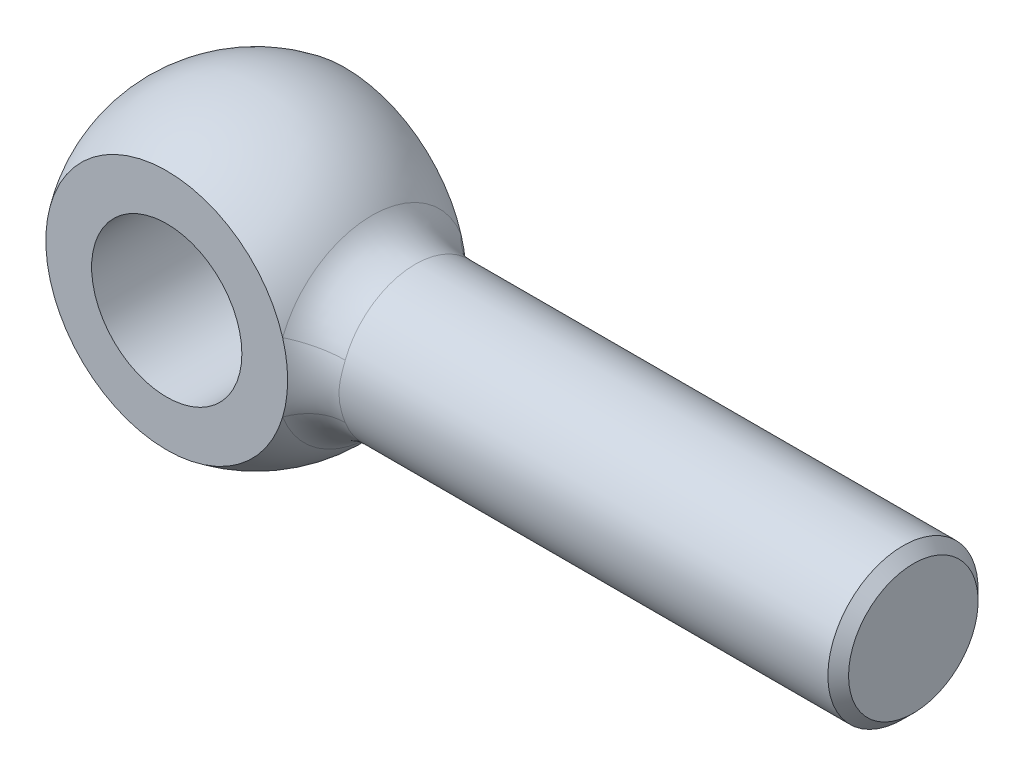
ISO-10303-21;
HEADER;
FILE_DESCRIPTION(('STEP AP214'),'2;1');
FILE_NAME('part.step','',(''),(''),'','','');
FILE_SCHEMA(('AUTOMOTIVE_DESIGN { 1 0 10303 214 1 1 1 1 }'));
ENDSEC;
DATA;
#1=APPLICATION_CONTEXT('core data for automotive mechanical design processes');
#2=APPLICATION_PROTOCOL_DEFINITION('international standard','automotive_design',2000,#1);
#3=PRODUCT_CONTEXT('',#1,'mechanical');
#4=PRODUCT('Part','Part','',(#3));
#5=PRODUCT_RELATED_PRODUCT_CATEGORY('part','',(#4));
#6=PRODUCT_DEFINITION_FORMATION('','',#4);
#7=PRODUCT_DEFINITION_CONTEXT('part definition',#1,'design');
#8=PRODUCT_DEFINITION('design','',#6,#7);
#9=PRODUCT_DEFINITION_SHAPE('','',#8);
#10=(LENGTH_UNIT() NAMED_UNIT(*) SI_UNIT(.MILLI.,.METRE.));
#11=(NAMED_UNIT(*) PLANE_ANGLE_UNIT() SI_UNIT($,.RADIAN.));
#12=(NAMED_UNIT(*) SI_UNIT($,.STERADIAN.) SOLID_ANGLE_UNIT());
#13=UNCERTAINTY_MEASURE_WITH_UNIT(LENGTH_MEASURE(1.E-05),#10,'distance_accuracy_value','');
#14=(GEOMETRIC_REPRESENTATION_CONTEXT(3) GLOBAL_UNCERTAINTY_ASSIGNED_CONTEXT((#13)) GLOBAL_UNIT_ASSIGNED_CONTEXT((#10,
#11,#12)) REPRESENTATION_CONTEXT('',''));
#15=CARTESIAN_POINT('',(0.,0.,0.));
#16=DIRECTION('',(0.,0.,1.));
#17=DIRECTION('',(1.,0.,0.));
#18=AXIS2_PLACEMENT_3D('',#15,#16,#17);
#19=CARTESIAN_POINT('',(-31.75,0.,0.));
#20=DIRECTION('',(-1.,0.,0.));
#21=DIRECTION('',(0.,0.,1.));
#22=AXIS2_PLACEMENT_3D('',#19,#20,#21);
#23=CYLINDRICAL_SURFACE('',#22,8.);
#24=CARTESIAN_POINT('',(16.9705627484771,0.,0.));
#25=DIRECTION('',(-1.,0.,0.));
#26=DIRECTION('',(0.,0.,1.));
#27=AXIS2_PLACEMENT_3D('',#24,#25,#26);
#28=CIRCLE('',#27,8.);
#29=CARTESIAN_POINT('',(16.9705627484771,2.87827010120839,-7.46428571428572));
#30=VERTEX_POINT('',#29);
#31=CARTESIAN_POINT('',(16.9705627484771,2.8782701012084,7.46428571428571));
#32=VERTEX_POINT('',#31);
#33=EDGE_CURVE('E108',#30,#32,#28,.F.);
#34=ORIENTED_EDGE('',*,*,#33,.T.);
#35=CARTESIAN_POINT('',(-4.11745676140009,-12.1982191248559,9.5));
#36=CARTESIAN_POINT('',(-4.09746878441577,-6.08702888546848,8.12264231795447));
#37=CARTESIAN_POINT('',(-4.56106447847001,-7.72139082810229,2.09287450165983));
#38=CARTESIAN_POINT('',(-3.91961749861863,-12.2650293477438,9.5));
#39=CARTESIAN_POINT('',(-3.89598467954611,-6.08103878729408,8.175591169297));
#40=CARTESIAN_POINT('',(-4.31845767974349,-7.72407680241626,2.08295572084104));
#41=CARTESIAN_POINT('',(-3.71705172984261,-12.3280129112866,9.5));
#42=CARTESIAN_POINT('',(-3.69221083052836,-6.07436691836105,8.22709930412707));
#43=CARTESIAN_POINT('',(-4.07567258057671,-7.72634870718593,2.07450765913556));
#44=CARTESIAN_POINT('',(-3.30356065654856,-12.4451782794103,9.5));
#45=CARTESIAN_POINT('',(-3.27786639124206,-6.06041146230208,8.32584579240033));
#46=CARTESIAN_POINT('',(-3.58989351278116,-7.73022190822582,2.06003280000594));
#47=CARTESIAN_POINT('',(-3.09263643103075,-12.499361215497,9.5));
#48=CARTESIAN_POINT('',(-3.06745371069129,-6.0531297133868,8.37299296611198));
#49=CARTESIAN_POINT('',(-3.34689957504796,-7.73182329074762,2.05400569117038));
#50=CARTESIAN_POINT('',(-2.66351305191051,-12.597784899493,9.5));
#51=CARTESIAN_POINT('',(-2.64020701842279,-6.0388105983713,8.46081476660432));
#52=CARTESIAN_POINT('',(-2.86083631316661,-7.73451332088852,2.0438512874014));
#53=CARTESIAN_POINT('',(-2.44531535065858,-12.6420276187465,9.5));
#54=CARTESIAN_POINT('',(-2.42362134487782,-6.03178518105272,8.50137687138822));
#55=CARTESIAN_POINT('',(-2.61776701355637,-7.73560207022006,2.03972361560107));
#56=CARTESIAN_POINT('',(-2.00300885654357,-12.7196050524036,9.5));
#57=CARTESIAN_POINT('',(-1.98470817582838,-6.01879116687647,8.57391000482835));
#58=CARTESIAN_POINT('',(-2.13155403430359,-7.73738830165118,2.03293754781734));
#59=CARTESIAN_POINT('',(-1.7788998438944,-12.7529393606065,9.5));
#60=CARTESIAN_POINT('',(-1.76271877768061,-6.01284072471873,8.60576182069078));
#61=CARTESIAN_POINT('',(-1.88841035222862,-7.73808576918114,2.03027920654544));
#62=CARTESIAN_POINT('',(-1.32412298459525,-12.8081884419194,9.5));
#63=CARTESIAN_POINT('',(-1.31192172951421,-6.0026497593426,8.65927965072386));
#64=CARTESIAN_POINT('',(-1.3996324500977,-7.73918780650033,2.02607416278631));
#65=CARTESIAN_POINT('',(-1.09341171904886,-12.8299842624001,9.5));
#66=CARTESIAN_POINT('',(-1.0835098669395,-5.99844630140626,8.6807328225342));
#67=CARTESIAN_POINT('',(-1.15399792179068,-7.73958934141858,2.02453897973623));
#68=CARTESIAN_POINT('',(-0.629515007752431,-12.8610944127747,9.5));
#69=CARTESIAN_POINT('',(-0.62371257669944,-5.99235718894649,8.71157589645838));
#70=CARTESIAN_POINT('',(-0.662714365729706,-7.74014973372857,2.02239543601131));
#71=CARTESIAN_POINT('',(-0.396329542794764,-12.8704086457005,9.5));
#72=CARTESIAN_POINT('',(-0.392823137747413,-5.99048462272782,8.72089860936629));
#73=CARTESIAN_POINT('',(-0.41706533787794,-7.74030858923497,2.02178708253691));
#74=CARTESIAN_POINT('',(0.0705265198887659,-12.8763164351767,9.5));
#75=CARTESIAN_POINT('',(0.0699739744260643,-5.98929957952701,8.72681425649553));
#76=CARTESIAN_POINT('',(0.074248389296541,-7.74041023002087,2.0213979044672));
#77=CARTESIAN_POINT('',(0.30419714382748,-12.8729092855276,9.5));
#78=CARTESIAN_POINT('',(0.301356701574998,-5.98998993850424,8.72339306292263));
#79=CARTESIAN_POINT('',(0.319913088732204,-7.74035300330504,2.02161712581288));
#80=CARTESIAN_POINT('',(0.769985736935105,-12.8534610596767,9.5));
#81=CARTESIAN_POINT('',(0.763065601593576,-5.99385634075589,8.70398983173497));
#82=CARTESIAN_POINT('',(0.811233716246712,-7.74001265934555,2.02291980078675));
#83=CARTESIAN_POINT('',(1.00210371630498,-12.8374200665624,9.5));
#84=CARTESIAN_POINT('',(0.992877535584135,-5.99702375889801,8.68805122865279));
#85=CARTESIAN_POINT('',(1.05688964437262,-7.73972954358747,2.02400324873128));
#86=CARTESIAN_POINT('',(1.47641140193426,-12.791804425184,9.5));
#87=CARTESIAN_POINT('',(1.46292208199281,-6.00571139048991,8.64331828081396));
#88=CARTESIAN_POINT('',(1.56265397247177,-7.73886729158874,2.02729778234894));
#89=CARTESIAN_POINT('',(1.71838873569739,-12.7614880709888,9.5));
#90=CARTESIAN_POINT('',(1.70249008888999,-6.01134062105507,8.61392098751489));
#91=CARTESIAN_POINT('',(1.82276111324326,-7.73827169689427,2.02957154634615));
#92=CARTESIAN_POINT('',(2.19630207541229,-12.6879754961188,9.5));
#93=CARTESIAN_POINT('',(2.17643606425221,-6.02419994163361,8.54411003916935));
#94=CARTESIAN_POINT('',(2.34292161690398,-7.7366801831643,2.03563008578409));
#95=CARTESIAN_POINT('',(2.43223805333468,-12.6447792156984,9.5));
#96=CARTESIAN_POINT('',(2.41035740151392,-6.03140676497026,8.50383721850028));
#97=CARTESIAN_POINT('',(2.60297497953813,-7.73568426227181,2.03941486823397));
#98=CARTESIAN_POINT('',(2.89630781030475,-12.5466200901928,9.5));
#99=CARTESIAN_POINT('',(2.87174186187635,-6.04645135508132,8.41478233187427));
#100=CARTESIAN_POINT('',(3.12303614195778,-7.7331548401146,2.0489854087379));
#101=CARTESIAN_POINT('',(3.12443945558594,-12.4916540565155,9.5));
#102=CARTESIAN_POINT('',(3.09886356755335,-6.05427144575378,8.36614202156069));
#103=CARTESIAN_POINT('',(3.38304391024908,-7.73162119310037,2.0547717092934));
#104=CARTESIAN_POINT('',(3.57135258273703,-12.3712976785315,9.5));
#105=CARTESIAN_POINT('',(3.54581351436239,-6.0694806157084,8.2630908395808));
#106=CARTESIAN_POINT('',(3.90283089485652,-7.72784115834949,2.06894309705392));
#107=CARTESIAN_POINT('',(3.79013416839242,-12.3059074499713,9.5));
#108=CARTESIAN_POINT('',(3.76542071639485,-6.07686389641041,8.20880116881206));
#109=CARTESIAN_POINT('',(4.16261011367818,-7.72559477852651,2.07732815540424));
#110=CARTESIAN_POINT('',(4.21627956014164,-12.1664716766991,9.5));
#111=CARTESIAN_POINT('',(4.19608565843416,-6.09012712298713,8.09735645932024));
#112=CARTESIAN_POINT('',(4.68059747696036,-7.72018846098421,2.09733112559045));
#113=CARTESIAN_POINT('',(4.42369015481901,-12.0924662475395,9.5));
#114=CARTESIAN_POINT('',(4.40705644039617,-6.09602262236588,8.04029857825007));
#115=CARTESIAN_POINT('',(4.93880744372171,-7.71703266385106,2.10893437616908));
#116=CARTESIAN_POINT('',(4.82738488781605,-11.9370491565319,9.5));
#117=CARTESIAN_POINT('',(4.82147550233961,-6.1054158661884,7.92545346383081));
#118=CARTESIAN_POINT('',(5.4545319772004,-7.70955496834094,2.13610908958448));
#119=CARTESIAN_POINT('',(5.02366974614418,-11.8556379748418,9.5));
#120=CARTESIAN_POINT('',(5.02490434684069,-6.10893737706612,7.86770220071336));
#121=CARTESIAN_POINT('',(5.71204658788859,-7.70523314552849,2.15168029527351));
#122=CARTESIAN_POINT('',(5.40457847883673,-11.6869115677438,9.5));
#123=CARTESIAN_POINT('',(5.42429501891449,-6.11278309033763,7.7534729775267));
#124=CARTESIAN_POINT('',(6.22582806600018,-7.69513485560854,2.18752071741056));
#125=CARTESIAN_POINT('',(5.58920990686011,-11.5996002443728,9.5));
#126=CARTESIAN_POINT('',(5.62031297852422,-6.1131440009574,7.69698894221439));
#127=CARTESIAN_POINT('',(6.48209564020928,-7.68935934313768,2.20778685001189));
#128=CARTESIAN_POINT('',(5.94679038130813,-11.420406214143,9.5));
#129=CARTESIAN_POINT('',(6.00520018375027,-6.11003584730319,7.58680312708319));
#130=CARTESIAN_POINT('',(6.99297248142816,-7.67601352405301,2.25375062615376));
#131=CARTESIAN_POINT('',(6.11974140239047,-11.3285242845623,9.5));
#132=CARTESIAN_POINT('',(6.19417787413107,-6.10660829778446,7.5330622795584));
#133=CARTESIAN_POINT('',(7.24758202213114,-7.66844352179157,2.27944734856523));
#134=CARTESIAN_POINT('',(6.39769976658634,-11.1729832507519,9.5));
#135=CARTESIAN_POINT('',(6.50311380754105,-6.09732532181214,7.44678688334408));
#136=CARTESIAN_POINT('',(7.66895239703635,-7.65403588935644,2.3272575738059));
#137=CARTESIAN_POINT('',(6.50594604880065,-11.1102592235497,9.5));
#138=CARTESIAN_POINT('',(6.6245451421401,-6.09270512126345,7.41329198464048));
#139=CARTESIAN_POINT('',(7.83637458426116,-7.64781262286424,2.3476556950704));
#140=CARTESIAN_POINT('',(6.71746100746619,-10.9836654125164,9.5));
#141=CARTESIAN_POINT('',(6.8643847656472,-6.08149836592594,7.34821264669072));
#142=CARTESIAN_POINT('',(8.16993354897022,-7.63427289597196,2.39131699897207));
#143=CARTESIAN_POINT('',(6.8207295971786,-10.9197956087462,9.5));
#144=CARTESIAN_POINT('',(6.98284083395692,-6.07492339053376,7.31660809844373));
#145=CARTESIAN_POINT('',(8.33607030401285,-7.62695641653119,2.41458023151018));
#146=CARTESIAN_POINT('',(7.12330896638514,-10.7268701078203,9.5));
#147=CARTESIAN_POINT('',(7.3326823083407,-6.05221031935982,7.22517403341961));
#148=CARTESIAN_POINT('',(8.83225443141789,-7.60315209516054,2.48893921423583));
#149=CARTESIAN_POINT('',(7.31534713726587,-10.5965244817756,9.5));
#150=CARTESIAN_POINT('',(7.56099668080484,-6.0330051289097,7.16803574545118));
#151=CARTESIAN_POINT('',(9.16000525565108,-7.58481165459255,2.5445964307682));
#152=CARTESIAN_POINT('',(7.67942635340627,-10.3356701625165,9.5));
#153=CARTESIAN_POINT('',(8.00300181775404,-5.98657004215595,7.06316228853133));
#154=CARTESIAN_POINT('',(9.80331638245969,-7.54213307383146,2.66842033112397));
#155=CARTESIAN_POINT('',(7.85164821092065,-10.2051761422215,9.5));
#156=CARTESIAN_POINT('',(8.21721471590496,-5.9594832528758,7.01518038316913));
#157=CARTESIAN_POINT('',(10.1189658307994,-7.51785676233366,2.73645631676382));
#158=CARTESIAN_POINT('',(8.17993892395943,-9.94397306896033,9.5));
#159=CARTESIAN_POINT('',(8.63319524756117,-5.89772344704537,6.92756931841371));
#160=CARTESIAN_POINT('',(10.73841188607,-7.46179959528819,2.88581150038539));
#161=CARTESIAN_POINT('',(8.33601118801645,-9.81326406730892,9.5));
#162=CARTESIAN_POINT('',(8.83536165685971,-5.86308225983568,6.88780086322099));
#163=CARTESIAN_POINT('',(11.0422109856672,-7.43002032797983,2.96712788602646));
#164=CARTESIAN_POINT('',(8.60796369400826,-9.57495166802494,9.5));
#165=CARTESIAN_POINT('',(9.19330840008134,-5.79378480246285,6.82203161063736));
#166=CARTESIAN_POINT('',(11.5830620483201,-7.36376059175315,3.12748668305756));
#167=CARTESIAN_POINT('',(8.72611217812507,-9.46728512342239,9.5));
#168=CARTESIAN_POINT('',(9.35104359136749,-5.76022453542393,6.79481195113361));
#169=CARTESIAN_POINT('',(11.8225303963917,-7.33071220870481,3.2044629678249));
#170=CARTESIAN_POINT('',(8.95380599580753,-9.25223659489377,9.5));
#171=CARTESIAN_POINT('',(9.65813400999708,-5.68939555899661,6.74501317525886));
#172=CARTESIAN_POINT('',(12.2892147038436,-7.25760146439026,3.36677011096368));
#173=CARTESIAN_POINT('',(9.06335224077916,-9.14485458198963,9.5));
#174=CARTESIAN_POINT('',(9.80764569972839,-5.65212430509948,6.72238917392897));
#175=CARTESIAN_POINT('',(12.5164319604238,-7.21753984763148,3.45210008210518));
#176=CARTESIAN_POINT('',(9.27516787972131,-8.92995329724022,9.5));
#177=CARTESIAN_POINT('',(10.0988906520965,-5.57464732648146,6.68138408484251));
#178=CARTESIAN_POINT('',(12.9572166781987,-7.12950676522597,3.63043149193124));
#179=CARTESIAN_POINT('',(9.37742332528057,-8.82243414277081,9.5));
#180=CARTESIAN_POINT('',(10.2407272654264,-5.53443088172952,6.66297789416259));
#181=CARTESIAN_POINT('',(13.1707578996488,-7.08152069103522,3.72344693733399));
#182=CARTESIAN_POINT('',(9.57552538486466,-8.60701608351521,9.5));
#183=CARTESIAN_POINT('',(10.5168609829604,-5.45192821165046,6.63036717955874));
#184=CARTESIAN_POINT('',(13.5820864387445,-6.97697380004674,3.91584181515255));
#185=CARTESIAN_POINT('',(9.67137181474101,-8.49911716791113,9.5));
#186=CARTESIAN_POINT('',(10.651235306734,-5.40963937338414,6.6161378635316));
#187=CARTESIAN_POINT('',(13.7798733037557,-6.92041273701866,4.01522143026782));
#188=CARTESIAN_POINT('',(9.8579277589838,-8.28201683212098,9.5));
#189=CARTESIAN_POINT('',(10.913491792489,-5.32346113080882,6.59210359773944));
#190=CARTESIAN_POINT('',(14.1588493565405,-6.79797696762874,4.21920532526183));
#191=CARTESIAN_POINT('',(9.94862159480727,-8.17281254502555,9.5));
#192=CARTESIAN_POINT('',(11.0413975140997,-5.27957023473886,6.58229007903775));
#193=CARTESIAN_POINT('',(14.3399888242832,-6.73207576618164,4.32382390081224));
#194=CARTESIAN_POINT('',(10.1254668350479,-7.95266337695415,9.5));
#195=CARTESIAN_POINT('',(11.2910101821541,-5.19052195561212,6.56775901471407));
#196=CARTESIAN_POINT('',(14.6839591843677,-6.59071314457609,4.53638465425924));
#197=CARTESIAN_POINT('',(10.2116182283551,-7.8417184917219,9.5));
#198=CARTESIAN_POINT('',(11.4127287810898,-5.14537623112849,6.56301925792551));
#199=CARTESIAN_POINT('',(14.8467900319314,-6.51525170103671,4.64432684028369));
#200=CARTESIAN_POINT('',(10.3800979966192,-7.61729903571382,9.5));
#201=CARTESIAN_POINT('',(11.6505282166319,-5.05354678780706,6.55950063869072));
#202=CARTESIAN_POINT('',(15.1534006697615,-6.35465242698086,4.86175372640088));
#203=CARTESIAN_POINT('',(10.4624276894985,-7.50382535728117,9.5));
#204=CARTESIAN_POINT('',(11.766600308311,-5.00688532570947,6.560692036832));
#205=CARTESIAN_POINT('',(15.2971870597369,-6.26951796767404,4.97123787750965));
#206=CARTESIAN_POINT('',(10.623880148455,-7.27344170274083,9.5));
#207=CARTESIAN_POINT('',(11.9935183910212,-4.91116594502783,6.56996516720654));
#208=CARTESIAN_POINT('',(15.5654780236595,-6.0896420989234,5.19002003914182));
#209=CARTESIAN_POINT('',(10.7030030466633,-7.15653186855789,9.5));
#210=CARTESIAN_POINT('',(12.1043408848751,-4.86214147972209,6.57800959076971));
#211=CARTESIAN_POINT('',(15.6899833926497,-5.9949010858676,5.29931805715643));
#212=CARTESIAN_POINT('',(10.8534683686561,-6.92603266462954,9.5));
#213=CARTESIAN_POINT('',(12.3139018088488,-4.76358316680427,6.60100176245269));
#214=CARTESIAN_POINT('',(15.912446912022,-5.80250452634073,5.50907261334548));
#215=CARTESIAN_POINT('',(10.9249844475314,-6.81271067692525,9.5));
#216=CARTESIAN_POINT('',(12.4129015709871,-4.71433946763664,6.61542928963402));
#217=CARTESIAN_POINT('',(16.0115950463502,-5.70542489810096,5.60964686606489));
#218=CARTESIAN_POINT('',(11.0657964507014,-6.58152522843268,9.5));
#219=CARTESIAN_POINT('',(12.6061731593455,-4.61112548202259,6.65133352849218));
#220=CARTESIAN_POINT('',(16.1935192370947,-5.50350332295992,5.80788036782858));
#221=CARTESIAN_POINT('',(11.1350914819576,-6.46365998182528,9.5));
#222=CARTESIAN_POINT('',(12.7004250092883,-4.557203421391,6.6727654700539));
#223=CARTESIAN_POINT('',(16.2762887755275,-5.39865830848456,5.90553844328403));
#224=CARTESIAN_POINT('',(11.2714769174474,-6.22277736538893,9.5));
#225=CARTESIAN_POINT('',(12.8836746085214,-4.4431058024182,6.72259955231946));
#226=CARTESIAN_POINT('',(16.4260369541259,-5.18181075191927,6.09669778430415));
#227=CARTESIAN_POINT('',(11.3385679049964,-6.09976137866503,9.5));
#228=CARTESIAN_POINT('',(12.972665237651,-4.38299403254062,6.75094741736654));
#229=CARTESIAN_POINT('',(16.4930198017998,-5.06981012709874,6.19020015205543));
#230=CARTESIAN_POINT('',(11.4704762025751,-5.8479374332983,9.5));
#231=CARTESIAN_POINT('',(13.1447760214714,-4.25498550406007,6.81406868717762));
#232=CARTESIAN_POINT('',(16.612108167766,-4.83929425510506,6.37203095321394));
#233=CARTESIAN_POINT('',(11.5352942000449,-5.71913125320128,9.5));
#234=CARTESIAN_POINT('',(13.2279037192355,-4.18716338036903,6.84878820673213));
#235=CARTESIAN_POINT('',(16.6642182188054,-4.72078100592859,6.46036095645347));
#236=CARTESIAN_POINT('',(11.6679249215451,-5.44378859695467,9.5));
#237=CARTESIAN_POINT('',(13.3944223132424,-4.03619053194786,6.92685429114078));
#238=CARTESIAN_POINT('',(16.7585851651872,-4.46750127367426,6.63832710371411));
#239=CARTESIAN_POINT('',(11.735520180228,-5.29667761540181,9.5));
#240=CARTESIAN_POINT('',(13.4773069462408,-3.95227546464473,6.97065290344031));
#241=CARTESIAN_POINT('',(16.7996194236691,-4.33221134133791,6.72742975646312));
#242=CARTESIAN_POINT('',(11.8674156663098,-4.99416391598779,9.5));
#243=CARTESIAN_POINT('',(13.6345577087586,-3.77224918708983,7.0628900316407));
#244=CARTESIAN_POINT('',(16.8672368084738,-4.05561403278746,6.89770824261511));
#245=CARTESIAN_POINT('',(11.9317157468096,-4.83876082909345,9.5));
#246=CARTESIAN_POINT('',(13.7089749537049,-3.6762372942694,7.11128923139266));
#247=CARTESIAN_POINT('',(16.8938192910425,-3.91430638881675,6.97888372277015));
#248=CARTESIAN_POINT('',(12.0565107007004,-4.51885595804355,9.5));
#249=CARTESIAN_POINT('',(13.8487041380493,-3.47102364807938,7.21060659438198));
#250=CARTESIAN_POINT('',(16.9345446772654,-3.62636581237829,7.13275200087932));
#251=CARTESIAN_POINT('',(12.1170006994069,-4.35434300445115,9.5));
#252=CARTESIAN_POINT('',(13.9140759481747,-3.36189219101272,7.2615137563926));
#253=CARTESIAN_POINT('',(16.9486719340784,-3.47972642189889,7.20543402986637));
#254=CARTESIAN_POINT('',(12.2333317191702,-4.0159204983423,9.5));
#255=CARTESIAN_POINT('',(14.0351943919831,-3.13023172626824,7.36338258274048));
#256=CARTESIAN_POINT('',(16.9666831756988,-3.18208838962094,7.34173832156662));
#257=CARTESIAN_POINT('',(12.2891718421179,-3.84200914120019,9.5));
#258=CARTESIAN_POINT('',(14.0910229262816,-3.0077612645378,7.41435799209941));
#259=CARTESIAN_POINT('',(16.9705651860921,-3.03108891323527,7.40535883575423));
#260=CARTESIAN_POINT('',(12.4138418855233,-3.42196773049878,9.5));
#261=CARTESIAN_POINT('',(14.2105988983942,-2.70482221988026,7.53116176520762));
#262=CARTESIAN_POINT('',(16.9705594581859,-2.67199536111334,7.54382517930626));
#263=CARTESIAN_POINT('',(12.4803830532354,-3.17185534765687,9.5));
#264=CARTESIAN_POINT('',(14.2706582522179,-2.51863017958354,7.59621445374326));
#265=CARTESIAN_POINT('',(16.9634788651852,-2.46240586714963,7.61481303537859));
#266=CARTESIAN_POINT('',(12.6006073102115,-2.65428594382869,9.5));
#267=CARTESIAN_POINT('',(14.3734467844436,-2.12444089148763,7.71598510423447));
#268=CARTESIAN_POINT('',(16.9418783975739,-2.03815466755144,7.73917520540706));
#269=CARTESIAN_POINT('',(12.6542858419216,-2.38682281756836,9.5));
#270=CARTESIAN_POINT('',(14.4163739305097,-1.91631714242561,7.77086307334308));
#271=CARTESIAN_POINT('',(16.9273558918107,-1.82349119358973,7.79254327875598));
#272=CARTESIAN_POINT('',(12.7457258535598,-1.83684928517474,9.5));
#273=CARTESIAN_POINT('',(14.4861673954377,-1.48267054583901,7.8650578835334));
#274=CARTESIAN_POINT('',(16.897924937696,-1.39061070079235,7.88130593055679));
#275=CARTESIAN_POINT('',(12.7834963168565,-1.55434747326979,9.5));
#276=CARTESIAN_POINT('',(14.5132026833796,-1.25684058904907,7.90456401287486));
#277=CARTESIAN_POINT('',(16.883016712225,-1.17239575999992,7.91671065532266));
#278=CARTESIAN_POINT('',(12.8403827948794,-0.978796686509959,9.5));
#279=CARTESIAN_POINT('',(14.5527726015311,-0.793996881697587,7.96411837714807));
#280=CARTESIAN_POINT('',(16.8590780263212,-0.733718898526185,7.96934382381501));
#281=CARTESIAN_POINT('',(12.8595032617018,-0.685750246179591,9.5));
#282=CARTESIAN_POINT('',(14.5654094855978,-0.556483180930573,7.98431139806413));
#283=CARTESIAN_POINT('',(16.8500461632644,-0.513257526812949,7.9865766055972));
#284=CARTESIAN_POINT('',(12.8774860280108,-0.0936003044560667,9.5));
#285=CARTESIAN_POINT('',(14.5772864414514,-0.0762325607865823,8.00325014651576));
#286=CARTESIAN_POINT('',(16.8415836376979,-0.0697296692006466,8.00279890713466));
#287=CARTESIAN_POINT('',(12.8761760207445,0.205533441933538,9.5));
#288=CARTESIAN_POINT('',(14.5764438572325,0.16716277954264,8.00186345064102));
#289=CARTESIAN_POINT('',(16.8422346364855,0.153343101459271,8.00163325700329));
#290=CARTESIAN_POINT('',(12.852999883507,0.799208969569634,9.5));
#291=CARTESIAN_POINT('',(14.5610811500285,0.648388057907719,7.97746368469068));
#292=CARTESIAN_POINT('',(16.853063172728,0.598556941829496,7.9806896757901));
#293=CARTESIAN_POINT('',(12.8311307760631,1.093750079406,9.5));
#294=CARTESIAN_POINT('',(14.5465186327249,0.886840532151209,7.95438343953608));
#295=CARTESIAN_POINT('',(16.8632420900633,0.820697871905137,7.96090904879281));
#296=CARTESIAN_POINT('',(12.7687022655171,1.67185097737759,9.5));
#297=CARTESIAN_POINT('',(14.5026322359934,1.35084127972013,7.88912180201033));
#298=CARTESIAN_POINT('',(16.8888513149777,1.26290557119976,7.90284198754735));
#299=CARTESIAN_POINT('',(12.7281038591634,1.9553865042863,9.5));
#300=CARTESIAN_POINT('',(14.4731667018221,1.57685535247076,7.84674716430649));
#301=CARTESIAN_POINT('',(16.9042925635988,1.48296702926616,7.8645169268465));
#302=CARTESIAN_POINT('',(12.6311456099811,2.50650394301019,9.5));
#303=CARTESIAN_POINT('',(14.3979926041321,2.00966575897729,7.74722499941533));
#304=CARTESIAN_POINT('',(16.9337447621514,1.91915293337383,7.76959896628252));
#305=CARTESIAN_POINT('',(12.574785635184,2.77408572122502,9.5));
#306=CARTESIAN_POINT('',(14.3521108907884,2.21675946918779,7.68989000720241));
#307=CARTESIAN_POINT('',(16.9477557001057,2.13527734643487,7.7130059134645));
#308=CARTESIAN_POINT('',(12.4491383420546,3.29248088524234,9.5));
#309=CARTESIAN_POINT('',(14.242715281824,2.60885024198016,7.56562610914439));
#310=CARTESIAN_POINT('',(16.967128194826,2.56301280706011,7.58163596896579));
#311=CARTESIAN_POINT('',(12.3798015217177,3.54322489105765,9.5));
#312=CARTESIAN_POINT('',(14.1789183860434,2.79384432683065,7.49850019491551));
#313=CARTESIAN_POINT('',(16.9724558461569,2.77460299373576,7.50678910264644));
#314=CARTESIAN_POINT('',(12.2310975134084,4.02669245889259,9.5));
#315=CARTESIAN_POINT('',(14.0333705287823,3.13905173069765,7.36091161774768));
#316=CARTESIAN_POINT('',(16.9674275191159,3.1907473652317,7.33957729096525));
#317=CARTESIAN_POINT('',(12.1517299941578,4.25941542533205,9.5));
#318=CARTESIAN_POINT('',(13.9513922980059,3.29918062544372,7.29036031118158));
#319=CARTESIAN_POINT('',(16.9570710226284,3.3953013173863,7.24721176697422));
#320=CARTESIAN_POINT('',(11.985469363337,4.70694435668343,9.5));
#321=CARTESIAN_POINT('',(13.7704062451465,3.5942640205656,7.15235705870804));
#322=CARTESIAN_POINT('',(16.9146060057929,3.79468286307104,7.0462877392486));
#323=CARTESIAN_POINT('',(11.8986035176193,4.9218100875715,9.5));
#324=CARTESIAN_POINT('',(13.6712600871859,3.72910789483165,7.08490176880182));
#325=CARTESIAN_POINT('',(16.8825736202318,3.9895419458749,6.93778694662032));
#326=CARTESIAN_POINT('',(11.7187336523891,5.33593747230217,9.5));
#327=CARTESIAN_POINT('',(13.4572636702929,3.97626915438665,6.95844608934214));
#328=CARTESIAN_POINT('',(16.7916148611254,4.36803082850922,6.70592872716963));
#329=CARTESIAN_POINT('',(11.6257326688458,5.53520673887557,9.5));
#330=CARTESIAN_POINT('',(13.3422875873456,4.08834320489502,6.8995408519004));
#331=CARTESIAN_POINT('',(16.7327017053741,4.55166609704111,6.58257862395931));
#332=CARTESIAN_POINT('',(11.4637204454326,5.8613479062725,9.5));
#333=CARTESIAN_POINT('',(13.1361112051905,4.26214058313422,6.81054925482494));
#334=CARTESIAN_POINT('',(16.6064703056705,4.85152219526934,6.36286334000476));
#335=CARTESIAN_POINT('',(11.3960314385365,5.99178245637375,9.5));
#336=CARTESIAN_POINT('',(13.0481052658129,4.32887634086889,6.7771242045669));
#337=CARTESIAN_POINT('',(16.5471793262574,4.97123852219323,6.2697242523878));
#338=CARTESIAN_POINT('',(11.2583135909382,6.24670810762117,9.5));
#339=CARTESIAN_POINT('',(12.8661698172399,4.45482777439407,6.71727308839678));
#340=CARTESIAN_POINT('',(16.4124309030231,5.20343224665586,6.07839604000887));
#341=CARTESIAN_POINT('',(11.1882852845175,6.37120055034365,9.5));
#342=CARTESIAN_POINT('',(12.7722414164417,4.51397039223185,6.69090304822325));
#343=CARTESIAN_POINT('',(16.3369771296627,5.31591128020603,5.98020806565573));
#344=CARTESIAN_POINT('',(11.0458805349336,6.61501792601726,9.5));
#345=CARTESIAN_POINT('',(12.5790137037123,4.62644292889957,6.64554225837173));
#346=CARTESIAN_POINT('',(16.168992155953,5.53301946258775,5.77992381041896));
#347=CARTESIAN_POINT('',(10.9735034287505,6.73434137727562,9.5));
#348=CARTESIAN_POINT('',(12.4797274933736,4.67970852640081,6.62660938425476));
#349=CARTESIAN_POINT('',(16.0764560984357,5.63764636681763,5.67782642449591));
#350=CARTESIAN_POINT('',(10.8262801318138,6.96855746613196,9.5));
#351=CARTESIAN_POINT('',(12.2761850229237,4.78204646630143,6.59601617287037));
#352=CARTESIAN_POINT('',(15.8737273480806,5.8384867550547,5.47109139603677));
#353=CARTESIAN_POINT('',(10.7514338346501,7.08344991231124,9.5));
#354=CARTESIAN_POINT('',(12.1719514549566,4.83106955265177,6.58440460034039));
#355=CARTESIAN_POINT('',(15.7635338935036,5.93469987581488,5.36645364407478));
#356=CARTESIAN_POINT('',(10.5988547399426,7.30978383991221,9.5));
#357=CARTESIAN_POINT('',(11.9584476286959,4.92639709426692,6.56792594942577));
#358=CARTESIAN_POINT('',(15.5250089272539,6.11848777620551,5.15593522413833));
#359=CARTESIAN_POINT('',(10.5211170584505,7.42121883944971,9.5));
#360=CARTESIAN_POINT('',(11.8491939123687,4.97265953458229,6.56310987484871));
#361=CARTESIAN_POINT('',(15.3966455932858,6.20604693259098,5.05005268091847));
#362=CARTESIAN_POINT('',(10.3624412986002,7.64121756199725,9.5));
#363=CARTESIAN_POINT('',(11.6256637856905,5.06338410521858,6.55949373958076));
#364=CARTESIAN_POINT('',(15.1219923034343,6.37213359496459,4.83879834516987));
#365=CARTESIAN_POINT('',(10.2815032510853,7.74978131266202,9.5));
#366=CARTESIAN_POINT('',(11.5114048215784,5.10782076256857,6.56072317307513));
#367=CARTESIAN_POINT('',(14.9757025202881,6.45066118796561,4.73342654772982));
#368=CARTESIAN_POINT('',(10.1158312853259,7.96482157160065,9.5));
#369=CARTESIAN_POINT('',(11.277456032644,5.1954398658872,6.56837253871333));
#370=CARTESIAN_POINT('',(14.665590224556,6.59869494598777,4.52477546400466));
#371=CARTESIAN_POINT('',(10.0310970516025,8.07129790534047,9.5));
#372=CARTESIAN_POINT('',(11.1577685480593,5.23860626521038,6.5748155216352));
#373=CARTESIAN_POINT('',(14.5017662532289,6.66820035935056,4.42149635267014));
#374=CARTESIAN_POINT('',(9.85711224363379,8.28287987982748,9.5));
#375=CARTESIAN_POINT('',(10.9124215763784,5.32374879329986,6.59218760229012));
#376=CARTESIAN_POINT('',(14.1573396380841,6.79838912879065,4.21858278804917));
#377=CARTESIAN_POINT('',(9.76786166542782,8.38798551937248,9.5));
#378=CARTESIAN_POINT('',(10.7867428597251,5.3657171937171,6.60313599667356));
#379=CARTESIAN_POINT('',(13.9767369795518,6.85907247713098,4.11894833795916));
#380=CARTESIAN_POINT('',(9.58682362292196,8.59424565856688,9.5));
#381=CARTESIAN_POINT('',(10.5328080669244,5.44685305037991,6.62866697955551));
#382=CARTESIAN_POINT('',(13.6056087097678,6.97027830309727,3.92773225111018));
#383=CARTESIAN_POINT('',(9.49519810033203,8.69542241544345,9.5));
#384=CARTESIAN_POINT('',(10.4046887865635,5.48607130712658,6.6431478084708));
#385=CARTESIAN_POINT('',(13.4155577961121,7.02105547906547,3.83599731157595));
#386=CARTESIAN_POINT('',(9.30604801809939,8.89756324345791,9.5));
#387=CARTESIAN_POINT('',(10.1418075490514,5.56251078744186,6.67576709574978));
#388=CARTESIAN_POINT('',(13.0218953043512,7.11520306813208,3.65841355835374));
#389=CARTESIAN_POINT('',(9.20852308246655,8.99852730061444,9.5));
#390=CARTESIAN_POINT('',(10.006972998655,5.59973479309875,6.69392777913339));
#391=CARTESIAN_POINT('',(12.818282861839,7.15857300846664,3.5725651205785));
#392=CARTESIAN_POINT('',(9.00687166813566,9.20035712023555,9.5));
#393=CARTESIAN_POINT('',(9.73060835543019,5.67142086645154,6.73398610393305));
#394=CARTESIAN_POINT('',(12.3993394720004,7.23843569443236,3.40784607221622));
#395=CARTESIAN_POINT('',(8.90275905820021,9.30122266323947,9.5));
#396=CARTESIAN_POINT('',(9.58898825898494,5.7058928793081,6.75590503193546));
#397=CARTESIAN_POINT('',(12.1840332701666,7.27494228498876,3.32896158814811));
#398=CARTESIAN_POINT('',(8.68680945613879,9.50322041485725,9.5));
#399=CARTESIAN_POINT('',(9.29860336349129,5.77147396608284,6.80380967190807));
#400=CARTESIAN_POINT('',(11.7428191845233,7.34187480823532,3.17862306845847));
#401=CARTESIAN_POINT('',(8.57497086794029,9.60435267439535,9.5));
#402=CARTESIAN_POINT('',(9.14970434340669,5.80258422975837,6.82983442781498));
#403=CARTESIAN_POINT('',(11.51690911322,7.37229947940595,3.10717057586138));
#404=CARTESIAN_POINT('',(8.30078675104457,9.84331834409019,9.5));
#405=CARTESIAN_POINT('',(8.78937337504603,5.87138869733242,6.89659916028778));
#406=CARTESIAN_POINT('',(10.9730480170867,7.43777170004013,2.94778594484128));
#407=CARTESIAN_POINT('',(8.13475776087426,9.98125170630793,9.5));
#408=CARTESIAN_POINT('',(8.57494114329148,5.90730336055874,6.93926905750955));
#409=CARTESIAN_POINT('',(10.6512513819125,7.47053771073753,2.86318691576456));
#410=CARTESIAN_POINT('',(7.78448371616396,10.2567756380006,9.5));
#411=CARTESIAN_POINT('',(8.13316663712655,5.97065903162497,7.03367570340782));
#412=CARTESIAN_POINT('',(9.99486935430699,7.52790683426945,2.70876617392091));
#413=CARTESIAN_POINT('',(7.60023585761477,10.3943661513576,9.5));
#414=CARTESIAN_POINT('',(7.90535016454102,5.99805963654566,7.08558001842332));
#415=CARTESIAN_POINT('',(9.6602819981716,7.55250868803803,2.63894674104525));
#416=CARTESIAN_POINT('',(7.3077198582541,10.6000774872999,9.5));
#417=CARTESIAN_POINT('',(7.55393379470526,6.03252683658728,7.17045732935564));
#418=CARTESIAN_POINT('',(9.14956413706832,7.58463211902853,2.54449590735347));
#419=CARTESIAN_POINT('',(7.20688121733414,10.6689390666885,9.5));
#420=CARTESIAN_POINT('',(7.43383087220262,6.04298909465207,7.20027869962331));
#421=CARTESIAN_POINT('',(8.97680790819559,7.59458758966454,2.51458015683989));
#422=CARTESIAN_POINT('',(6.99986546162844,10.8058915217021,9.5));
#423=CARTESIAN_POINT('',(7.19036255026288,6.06165029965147,7.26224815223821));
#424=CARTESIAN_POINT('',(8.62931418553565,7.61301554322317,2.45822659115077));
#425=CARTESIAN_POINT('',(6.89368819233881,10.8739823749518,9.5));
#426=CARTESIAN_POINT('',(7.06693473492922,6.06983769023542,7.29442184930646));
#427=CARTESIAN_POINT('',(8.45457663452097,7.62148798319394,2.43178887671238));
#428=CARTESIAN_POINT('',(6.67584106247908,11.0090675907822,9.5));
#429=CARTESIAN_POINT('',(6.81683239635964,6.08399379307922,7.36096404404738));
#430=CARTESIAN_POINT('',(8.10350614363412,7.63712546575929,2.38222354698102));
#431=CARTESIAN_POINT('',(6.56417135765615,11.0760619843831,9.5));
#432=CARTESIAN_POINT('',(6.69009884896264,6.08994944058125,7.39535733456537));
#433=CARTESIAN_POINT('',(7.92717324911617,7.64429054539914,2.35909583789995));
#434=CARTESIAN_POINT('',(6.33522815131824,11.2085850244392,9.5));
#435=CARTESIAN_POINT('',(6.4333616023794,6.09973568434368,7.46611811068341));
#436=CARTESIAN_POINT('',(7.57323996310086,7.65747321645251,2.31594702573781));
#437=CARTESIAN_POINT('',(6.21795511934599,11.2741137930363,9.5));
#438=CARTESIAN_POINT('',(6.30330450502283,6.1035523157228,7.50250794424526));
#439=CARTESIAN_POINT('',(7.39563967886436,7.66349090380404,2.2959256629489));
#440=CARTESIAN_POINT('',(5.88585230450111,11.4527143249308,9.5));
#441=CARTESIAN_POINT('',(5.93809455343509,6.11136486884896,7.60573524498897));
#442=CARTESIAN_POINT('',(6.90323782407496,7.67874693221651,2.24455563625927));
#443=CARTESIAN_POINT('',(5.66498848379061,11.5638294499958,9.5));
#444=CARTESIAN_POINT('',(5.70024421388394,6.11316467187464,7.67414360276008));
#445=CARTESIAN_POINT('',(6.58735714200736,7.68692987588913,2.21625051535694));
#446=CARTESIAN_POINT('',(5.20546294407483,11.7778347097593,9.5));
#447=CARTESIAN_POINT('',(5.21371355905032,6.11159428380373,7.81381127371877));
#448=CARTESIAN_POINT('',(5.95360080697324,7.70088310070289,2.16726540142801));
#449=CARTESIAN_POINT('',(4.96679646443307,11.8807226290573,9.5));
#450=CARTESIAN_POINT('',(4.96488702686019,6.10815136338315,7.88510893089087));
#451=CARTESIAN_POINT('',(5.63572464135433,7.7066527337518,2.14658745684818));
#452=CARTESIAN_POINT('',(4.47207559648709,12.0756480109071,9.5));
#453=CARTESIAN_POINT('',(4.45551626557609,6.09747919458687,8.02728179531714));
#454=CARTESIAN_POINT('',(4.99850918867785,7.7163551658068,2.11144346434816));
#455=CARTESIAN_POINT('',(4.21600230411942,12.1676733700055,9.5));
#456=CARTESIAN_POINT('',(4.19497675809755,6.09019736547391,8.09810074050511));
#457=CARTESIAN_POINT('',(4.67916867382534,7.72028593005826,2.09698429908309));
#458=CARTESIAN_POINT('',(3.68811186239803,12.3379378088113,9.5));
#459=CARTESIAN_POINT('',(3.66204056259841,6.07355075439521,8.23499075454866));
#460=CARTESIAN_POINT('',(4.03992945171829,7.72677467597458,2.07294599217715));
#461=CARTESIAN_POINT('',(3.41629581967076,12.4161778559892,9.5));
#462=CARTESIAN_POINT('',(3.3898690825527,6.0641709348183,8.3009035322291));
#463=CARTESIAN_POINT('',(3.72003078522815,7.72933275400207,2.06336650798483));
#464=CARTESIAN_POINT('',(2.85781461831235,12.5565180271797,9.5));
#465=CARTESIAN_POINT('',(2.83258724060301,6.04518969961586,8.42340620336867));
#466=CARTESIAN_POINT('',(3.07846733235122,7.73346956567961,2.04780661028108));
#467=CARTESIAN_POINT('',(2.57108619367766,12.6185412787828,9.5));
#468=CARTESIAN_POINT('',(2.54792407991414,6.03560705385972,8.47970132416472));
#469=CARTESIAN_POINT('',(2.75680125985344,7.73504368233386,2.04184316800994));
#470=CARTESIAN_POINT('',(1.98703497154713,12.7235882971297,9.5));
#471=CARTESIAN_POINT('',(1.96824034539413,6.01818556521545,8.57757776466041));
#472=CARTESIAN_POINT('',(2.1133491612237,7.73749467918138,2.03253490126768));
#473=CARTESIAN_POINT('',(1.68971204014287,12.7666118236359,9.5));
#474=CARTESIAN_POINT('',(1.67398828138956,6.01038820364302,8.6188820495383));
#475=CARTESIAN_POINT('',(1.79156313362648,7.73837155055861,2.02919010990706));
#476=CARTESIAN_POINT('',(1.08841149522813,12.8318652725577,9.5));
#477=CARTESIAN_POINT('',(1.07800420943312,5.99814150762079,8.68251314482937));
#478=CARTESIAN_POINT('',(1.14805243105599,7.73963637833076,2.02436025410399));
#479=CARTESIAN_POINT('',(0.78443604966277,12.854101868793,9.5));
#480=CARTESIAN_POINT('',(0.777288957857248,5.99373198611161,8.70462454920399));
#481=CARTESIAN_POINT('',(0.826327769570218,7.74002449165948,2.02287459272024));
#482=CARTESIAN_POINT('',(0.174103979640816,12.8768367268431,9.5));
#483=CARTESIAN_POINT('',(0.172290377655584,5.98920388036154,8.72732417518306));
#484=CARTESIAN_POINT('',(0.182869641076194,7.74042095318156,2.02135695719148));
#485=CARTESIAN_POINT('',(-0.132252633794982,12.8773350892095,9.5));
#486=CARTESIAN_POINT('',(-0.130829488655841,5.98910272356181,8.72782500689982));
#487=CARTESIAN_POINT('',(-0.138863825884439,7.74042930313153,2.02132497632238));
#488=CARTESIAN_POINT('',(-0.720382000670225,12.8573401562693,9.5));
#489=CARTESIAN_POINT('',(-0.713862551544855,5.9930892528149,8.70785077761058));
#490=CARTESIAN_POINT('',(-0.758703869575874,7.7400811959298,2.02265755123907));
#491=CARTESIAN_POINT('',(-1.00230854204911,12.8383851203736,9.5));
#492=CARTESIAN_POINT('',(-0.992844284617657,5.99685677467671,8.68897900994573));
#493=CARTESIAN_POINT('',(-1.056811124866,7.73975147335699,2.02391976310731));
#494=CARTESIAN_POINT('',(-1.56079824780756,12.782514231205,9.5));
#495=CARTESIAN_POINT('',(-1.54638214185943,6.00745152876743,8.63427795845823));
#496=CARTESIAN_POINT('',(-1.65299071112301,7.738687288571,2.0279851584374));
#497=CARTESIAN_POINT('',(-1.83736146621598,12.7455985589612,9.5));
#498=CARTESIAN_POINT('',(-1.82011267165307,6.01424762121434,8.59861510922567));
#499=CARTESIAN_POINT('',(-1.95106304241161,7.73795283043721,2.03078832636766));
#500=CARTESIAN_POINT('',(-2.38182915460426,12.6551579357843,9.5));
#501=CARTESIAN_POINT('',(-2.36024271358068,6.02969400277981,8.51346814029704));
#502=CARTESIAN_POINT('',(-2.54693996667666,7.73592619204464,2.03849514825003));
#503=CARTESIAN_POINT('',(-2.64973886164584,12.6016432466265,9.5));
#504=CARTESIAN_POINT('',(-2.62599444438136,6.03830877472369,8.46420944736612));
#505=CARTESIAN_POINT('',(-2.84474461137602,7.7346343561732,2.04339750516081));
#506=CARTESIAN_POINT('',(-3.17449588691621,12.4797899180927,9.5));
#507=CARTESIAN_POINT('',(-3.14858291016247,6.05587766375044,8.35578255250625));
#508=CARTESIAN_POINT('',(-3.44017761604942,7.73127059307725,2.05608832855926));
#509=CARTESIAN_POINT('',(-3.43134259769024,12.4114504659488,9.5));
#510=CARTESIAN_POINT('',(-3.40497304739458,6.06481052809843,8.29682180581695));
#511=CARTESIAN_POINT('',(-3.73780596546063,7.72919862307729,2.06387695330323));
#512=CARTESIAN_POINT('',(-3.9294420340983,12.262804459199,9.5));
#513=CARTESIAN_POINT('',(-3.90545646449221,6.08133055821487,8.17371684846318));
#514=CARTESIAN_POINT('',(-4.32965503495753,7.72401354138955,2.08319837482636));
#515=CARTESIAN_POINT('',(-4.1708262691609,12.1826260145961,9.5));
#516=CARTESIAN_POINT('',(-4.14937824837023,6.08893193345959,8.10978836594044));
#517=CARTESIAN_POINT('',(-4.62387975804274,7.72091117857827,2.09469248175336));
#518=CARTESIAN_POINT('',(-4.63942908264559,12.0119891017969,9.5));
#519=CARTESIAN_POINT('',(-4.62741785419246,6.10144088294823,7.97994002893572));
#520=CARTESIAN_POINT('',(-5.21153765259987,7.71331886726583,2.12247989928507));
#521=CARTESIAN_POINT('',(-4.86665044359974,11.9215326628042,9.5));
#522=CARTESIAN_POINT('',(-4.8614626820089,6.1063765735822,7.9140973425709));
#523=CARTESIAN_POINT('',(-5.50497096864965,7.70882919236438,2.1387722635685));
#524=CARTESIAN_POINT('',(-5.3067648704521,11.7322539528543,9.5));
#525=CARTESIAN_POINT('',(-5.32055601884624,6.11231533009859,7.78334178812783));
#526=CARTESIAN_POINT('',(-6.09130351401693,7.69803797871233,2.17729585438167));
#527=CARTESIAN_POINT('',(-5.51962165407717,11.633411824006,9.5));
#528=CARTESIAN_POINT('',(-5.54564501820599,6.11335733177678,7.7184338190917));
#529=CARTESIAN_POINT('',(-6.38419969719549,7.69173204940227,2.19954146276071));
#530=CARTESIAN_POINT('',(-5.82756211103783,11.4805345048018,9.5));
#531=CARTESIAN_POINT('',(-5.87736698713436,6.11120601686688,7.62337495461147));
#532=CARTESIAN_POINT('',(-6.82208489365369,7.68054356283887,2.23817504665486));
#533=CARTESIAN_POINT('',(-5.92835299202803,11.428786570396,9.5));
#534=CARTESIAN_POINT('',(-5.98650903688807,6.10988346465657,7.59219877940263));
#535=CARTESIAN_POINT('',(-6.96785658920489,7.67652401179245,2.25193644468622));
#536=CARTESIAN_POINT('',(-6.12615743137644,11.3239886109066,9.5));
#537=CARTESIAN_POINT('',(-6.20251311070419,6.10591777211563,7.53092674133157));
#538=CARTESIAN_POINT('',(-7.25877230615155,7.66783506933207,2.28134541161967));
#539=CARTESIAN_POINT('',(-6.22317056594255,11.2709384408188,9.5));
#540=CARTESIAN_POINT('',(-6.30939886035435,6.10328229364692,7.50082157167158));
#541=CARTESIAN_POINT('',(-7.40391625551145,7.66316560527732,2.29699319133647));
#542=CARTESIAN_POINT('',(-6.3183010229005,11.2173558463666,9.5));
#543=CARTESIAN_POINT('',(-6.41548013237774,6.09993220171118,7.47127153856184));
#544=CARTESIAN_POINT('',(-7.54867757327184,7.6581349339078,2.31364848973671));
#545=(BOUNDED_SURFACE() B_SPLINE_SURFACE(3,2,((#35,#36,#37),(#38,#39,#40),(#41,#42,#43),(#44,
#45,#46),(#47,#48,#49),(#50,#51,#52),(#53,#54,#55),(#56,#57,#58),(#59,#60,#61),(#62,#63,#64),
(#65,#66,#67),(#68,#69,#70),(#71,#72,#73),(#74,#75,#76),(#77,#78,#79),(#80,#81,#82),(#83,#84,
#85),(#86,#87,#88),(#89,#90,#91),(#92,#93,#94),(#95,#96,#97),(#98,#99,#100),(#101,#102,#103),
(#104,#105,#106),(#107,#108,#109),(#110,#111,#112),(#113,#114,#115),(#116,#117,#118),(#119,#120,
#121),(#122,#123,#124),(#125,#126,#127),(#128,#129,#130),(#131,#132,#133),(#134,#135,#136),
(#137,#138,#139),(#140,#141,#142),(#143,#144,#145),(#146,#147,#148),(#149,#150,#151),(#152,#153,
#154),(#155,#156,#157),(#158,#159,#160),(#161,#162,#163),(#164,#165,#166),(#167,#168,#169),
(#170,#171,#172),(#173,#174,#175),(#176,#177,#178),(#179,#180,#181),(#182,#183,#184),(#185,#186,
#187),(#188,#189,#190),(#191,#192,#193),(#194,#195,#196),(#197,#198,#199),(#200,#201,#202),
(#203,#204,#205),(#206,#207,#208),(#209,#210,#211),(#212,#213,#214),(#215,#216,#217),(#218,#219,
#220),(#221,#222,#223),(#224,#225,#226),(#227,#228,#229),(#230,#231,#232),(#233,#234,#235),
(#236,#237,#238),(#239,#240,#241),(#242,#243,#244),(#245,#246,#247),(#248,#249,#250),(#251,#252,
#253),(#254,#255,#256),(#257,#258,#259),(#260,#261,#262),(#263,#264,#265),(#266,#267,#268),
(#269,#270,#271),(#272,#273,#274),(#275,#276,#277),(#278,#279,#280),(#281,#282,#283),(#284,#285,
#286),(#287,#288,#289),(#290,#291,#292),(#293,#294,#295),(#296,#297,#298),(#299,#300,#301),
(#302,#303,#304),(#305,#306,#307),(#308,#309,#310),(#311,#312,#313),(#314,#315,#316),(#317,#318,
#319),(#320,#321,#322),(#323,#324,#325),(#326,#327,#328),(#329,#330,#331),(#332,#333,#334),
(#335,#336,#337),(#338,#339,#340),(#341,#342,#343),(#344,#345,#346),(#347,#348,#349),(#350,#351,
#352),(#353,#354,#355),(#356,#357,#358),(#359,#360,#361),(#362,#363,#364),(#365,#366,#367),
(#368,#369,#370),(#371,#372,#373),(#374,#375,#376),(#377,#378,#379),(#380,#381,#382),(#383,#384,
#385),(#386,#387,#388),(#389,#390,#391),(#392,#393,#394),(#395,#396,#397),(#398,#399,#400),
(#401,#402,#403),(#404,#405,#406),(#407,#408,#409),(#410,#411,#412),(#413,#414,#415),(#416,#417,
#418),(#419,#420,#421),(#422,#423,#424),(#425,#426,#427),(#428,#429,#430),(#431,#432,#433),
(#434,#435,#436),(#437,#438,#439),(#440,#441,#442),(#443,#444,#445),(#446,#447,#448),(#449,#450,
#451),(#452,#453,#454),(#455,#456,#457),(#458,#459,#460),(#461,#462,#463),(#464,#465,#466),
(#467,#468,#469),(#470,#471,#472),(#473,#474,#475),(#476,#477,#478),(#479,#480,#481),(#482,#483,
#484),(#485,#486,#487),(#488,#489,#490),(#491,#492,#493),(#494,#495,#496),(#497,#498,#499),
(#500,#501,#502),(#503,#504,#505),(#506,#507,#508),(#509,#510,#511),(#512,#513,#514),(#515,#516,
#517),(#518,#519,#520),(#521,#522,#523),(#524,#525,#526),(#527,#528,#529),(#530,#531,#532),
(#533,#534,#535),(#536,#537,#538),(#539,#540,#541),(#542,#543,#544)),.UNSPECIFIED.,.F.,.F.,
.F.) B_SPLINE_SURFACE_WITH_KNOTS((4,2,2,2,2,2,2,2,2,2,2,2,2,2,2,2,2,2,2,2,2,2,2,2,2,2,2,2,2,2,2,
2,2,2,2,2,2,2,2,2,2,2,2,2,2,2,2,2,2,2,2,2,2,2,2,2,2,2,2,2,2,2,2,2,2,2,2,2,2,2,2,2,2,2,2,2,2,2,2,
2,2,2,2,2,4),(3,3),(0.,0.729773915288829,1.45945392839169,2.18898910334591,2.91855144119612,
3.65549532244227,4.39244492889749,5.12943544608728,5.86642111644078,6.64682937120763,
7.42724124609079,8.20786481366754,8.98847971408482,9.76559515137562,10.5426602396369,
11.319216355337,12.0956408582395,12.6101518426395,13.1246717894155,14.1539267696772,
15.1728863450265,16.1916304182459,17.0331183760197,17.8745170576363,18.7174845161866,
19.5604761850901,20.4059088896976,21.2513436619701,22.0964846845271,22.9415908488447,
23.7325355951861,24.5237944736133,25.314842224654,26.1056486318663,26.9640375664,
27.822464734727,28.6819687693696,29.5416384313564,30.7020200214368,31.8628121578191,
33.0229479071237,34.1828066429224,35.3524526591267,36.5222680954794,37.694530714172,
38.8668031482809,40.0436420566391,41.2205198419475,42.3932852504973,43.565474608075,
44.380587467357,45.1955154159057,46.0106754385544,46.8258706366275,47.6425116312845,
48.4591447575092,49.2758458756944,50.0925477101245,50.8841827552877,51.6758683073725,
52.4659393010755,53.2561740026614,54.3310183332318,55.4060283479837,55.9499796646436,
56.4939467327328,57.0378983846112,57.5818045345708,58.5415713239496,59.501595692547,
60.4626798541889,61.423696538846,62.3891893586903,63.354694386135,64.3198893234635,
65.2850797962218,66.1794180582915,67.0737473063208,67.9675247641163,68.8613512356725,
69.746131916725,70.6307382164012,71.5175011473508,71.9612078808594,72.4049642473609),(0.,1.),
.UNSPECIFIED.) GEOMETRIC_REPRESENTATION_ITEM() RATIONAL_B_SPLINE_SURFACE(((1.,0.691695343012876,
1.),(1.,0.688274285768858,1.),(1.,0.684978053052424,1.),(1.,0.678745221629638,1.),(1.,
0.67580857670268,1.),(1.,0.670404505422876,1.),(1.,0.667936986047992,1.),(1.,0.663568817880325,
1.),(1.,0.661668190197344,1.),(1.,0.658498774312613,1.),(1.,0.657236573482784,1.),(1.,
0.655430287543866,1.),(1.,0.654886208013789,1.),(1.,0.654541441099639,1.),(1.,0.654740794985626,
1.),(1.,0.655873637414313,1.),(1.,0.656807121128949,1.),(1.,0.659440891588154,1.),(1.,
0.66118311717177,1.),(1.,0.665356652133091,1.),(1.,0.667787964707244,1.),(1.,0.673226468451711,
1.),(1.,0.676233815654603,1.),(1.,0.682693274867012,1.),(1.,0.686145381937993,1.),(1.,
0.693341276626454,1.),(1.,0.697083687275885,1.),(1.,0.704740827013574,1.),(1.,0.708655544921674,
1.),(1.,0.716531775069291,1.),(1.,0.720493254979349,1.),(1.,0.728356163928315,1.),(1.,
0.732257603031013,1.),(1.,0.738619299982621,1.),(1.,0.741121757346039,1.),(1.,0.74603952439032,
1.),(1.,0.748454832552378,1.),(1.,0.755543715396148,1.),(1.,0.760059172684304,1.),(1.,
0.76853130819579,1.),(1.,0.772493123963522,1.),(1.,0.779889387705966,1.),(1.,0.783323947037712,
1.),(1.,0.789152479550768,1.),(1.,0.791623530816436,1.),(1.,0.796287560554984,1.),(1.,
0.798480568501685,1.),(1.,0.802664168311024,1.),(1.,0.804654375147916,1.),(1.,0.80851306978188,
1.),(1.,0.810381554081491,1.),(1.,0.814091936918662,1.),(1.,0.815933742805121,1.),(1.,
0.819671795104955,1.),(1.,0.821568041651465,1.),(1.,0.825488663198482,1.),(1.,0.827512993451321,
1.),(1.,0.831746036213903,1.),(1.,0.83395474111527,1.),(1.,0.838440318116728,1.),(1.,
0.84070374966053,1.),(1.,0.845428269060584,1.),(1.,0.84788943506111,1.),(1.,0.852995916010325,
1.),(1.,0.855641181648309,1.),(1.,0.861086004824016,1.),(1.,0.863885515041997,1.),(1.,
0.86983937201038,1.),(1.,0.873003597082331,1.),(1.,0.879389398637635,1.),(1.,0.88261097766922,
1.),(1.,0.889029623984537,1.),(1.,0.892226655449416,1.),(1.,0.898497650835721,1.),(1.,
0.901571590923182,1.),(1.,0.90853273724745,1.),(1.,0.91232829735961,1.),(1.,0.919261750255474,
1.),(1.,0.922399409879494,1.),(1.,0.927773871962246,1.),(1.,0.930011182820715,1.),(1.,
0.933387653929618,1.),(1.,0.934527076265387,1.),(1.,0.93559858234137,1.),(1.,0.935520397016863,
1.),(1.,0.934139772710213,1.),(1.,0.93283715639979,1.),(1.,0.929135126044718,1.),(1.,
0.926733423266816,1.),(1.,0.92104652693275,1.),(1.,0.917761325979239,1.),(1.,0.910544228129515,
1.),(1.,0.906609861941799,1.),(1.,0.89836540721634,1.),(1.,0.894055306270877,1.),(1.,
0.885327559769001,1.),(1.,0.880910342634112,1.),(1.,0.872180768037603,1.),(1.,0.867868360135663,
1.),(1.,0.860799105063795,1.),(1.,0.857968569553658,1.),(1.,0.852486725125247,1.),(1.,
0.849835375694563,1.),(1.,0.84473594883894,1.),(1.,0.842287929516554,1.),(1.,0.837600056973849,
1.),(1.,0.83536021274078,1.),(1.,0.831067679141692,1.),(1.,0.829015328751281,1.),(1.,
0.825063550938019,1.),(1.,0.823164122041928,1.),(1.,0.819460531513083,1.),(1.,0.817656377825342,
1.),(1.,0.814071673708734,1.),(1.,0.81229112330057,1.),(1.,0.808729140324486,1.),(1.,
0.80694941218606,1.),(1.,0.803262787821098,1.),(1.,0.801355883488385,1.),(1.,0.797350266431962,
1.),(1.,0.795251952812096,1.),(1.,0.790803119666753,1.),(1.,0.78845254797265,1.),(1.,
0.782557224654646,1.),(1.,0.778887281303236,1.),(1.,0.77095800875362,1.),(1.,0.766698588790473,
1.),(1.,0.759871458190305,1.),(1.,0.757507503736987,1.),(1.,0.752652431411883,1.),(1.,
0.750161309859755,1.),(1.,0.745069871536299,1.),(1.,0.742469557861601,1.),(1.,0.737183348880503,
1.),(1.,0.734497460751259,1.),(1.,0.726991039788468,1.),(1.,0.722108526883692,1.),(1.,
0.712348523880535,1.),(1.,0.707471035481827,1.),(1.,0.697943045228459,1.),(1.,0.693292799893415,
1.),(1.,0.684475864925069,1.),(1.,0.680309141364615,1.),(1.,0.67269619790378,1.),(1.,
0.669253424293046,1.),(1.,0.663349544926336,1.),(1.,0.660888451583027,1.),(1.,0.657132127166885,
1.),(1.,0.655836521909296,1.),(1.,0.654511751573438,1.),(1.,0.654482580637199,1.),(1.,
0.655647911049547,1.),(1.,0.656752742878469,1.),(1.,0.659975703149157,1.),(1.,0.662093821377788,
1.),(1.,0.667204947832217,1.),(1.,0.670197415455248,1.),(1.,0.676877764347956,1.),(1.,
0.680565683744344,1.),(1.,0.688394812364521,1.),(1.,0.692531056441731,1.),(1.,0.70108709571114,
1.),(1.,0.705506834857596,1.),(1.,0.7144548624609,1.),(1.,0.718983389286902,1.),(1.,
0.725727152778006,1.),(1.,0.727967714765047,1.),(1.,0.73241498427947,1.),(1.,0.734621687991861,
1.),(1.,0.736802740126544,1.))) REPRESENTATION_ITEM('') SURFACE());
#546=CARTESIAN_POINT('',(-7.54867757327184,7.6581349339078,2.31364848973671));
#547=CARTESIAN_POINT('',(-7.40391625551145,7.66316560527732,2.29699319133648));
#548=CARTESIAN_POINT('',(-7.25877230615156,7.66783506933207,2.28134541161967));
#549=CARTESIAN_POINT('',(-6.9678565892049,7.67652401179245,2.25193644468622));
#550=CARTESIAN_POINT('',(-6.82208489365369,7.68054356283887,2.23817504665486));
#551=CARTESIAN_POINT('',(-6.38419969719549,7.69173204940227,2.19954146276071));
#552=CARTESIAN_POINT('',(-6.09130351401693,7.69803797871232,2.17729585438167));
#553=CARTESIAN_POINT('',(-5.50497096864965,7.70882919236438,2.1387722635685));
#554=CARTESIAN_POINT('',(-5.21153765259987,7.71331886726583,2.12247989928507));
#555=CARTESIAN_POINT('',(-4.62387975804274,7.72091117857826,2.09469248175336));
#556=CARTESIAN_POINT('',(-4.32965503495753,7.72401354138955,2.08319837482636));
#557=CARTESIAN_POINT('',(-3.73780596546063,7.72919862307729,2.06387695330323));
#558=CARTESIAN_POINT('',(-3.44017761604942,7.73127059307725,2.05608832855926));
#559=CARTESIAN_POINT('',(-2.84474461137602,7.7346343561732,2.04339750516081));
#560=CARTESIAN_POINT('',(-2.54693996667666,7.73592619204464,2.03849514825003));
#561=CARTESIAN_POINT('',(-1.95106304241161,7.73795283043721,2.03078832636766));
#562=CARTESIAN_POINT('',(-1.65299071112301,7.73868728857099,2.0279851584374));
#563=CARTESIAN_POINT('',(-1.056811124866,7.73975147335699,2.02391976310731));
#564=CARTESIAN_POINT('',(-0.758703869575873,7.7400811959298,2.02265755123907));
#565=CARTESIAN_POINT('',(-0.138863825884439,7.74042930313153,2.02132497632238));
#566=CARTESIAN_POINT('',(0.182869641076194,7.74042095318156,2.02135695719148));
#567=CARTESIAN_POINT('',(0.826327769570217,7.74002449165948,2.02287459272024));
#568=CARTESIAN_POINT('',(1.14805243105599,7.73963637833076,2.02436025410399));
#569=CARTESIAN_POINT('',(1.79156313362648,7.73837155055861,2.02919010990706));
#570=CARTESIAN_POINT('',(2.1133491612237,7.73749467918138,2.03253490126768));
#571=CARTESIAN_POINT('',(2.75680125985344,7.73504368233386,2.04184316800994));
#572=CARTESIAN_POINT('',(3.07846733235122,7.73346956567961,2.04780661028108));
#573=CARTESIAN_POINT('',(3.72003078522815,7.72933275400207,2.06336650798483));
#574=CARTESIAN_POINT('',(4.03992945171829,7.72677467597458,2.07294599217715));
#575=CARTESIAN_POINT('',(4.67916867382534,7.72028593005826,2.09698429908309));
#576=CARTESIAN_POINT('',(4.99850918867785,7.7163551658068,2.11144346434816));
#577=CARTESIAN_POINT('',(5.63572464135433,7.7066527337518,2.14658745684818));
#578=CARTESIAN_POINT('',(5.95360080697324,7.70088310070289,2.16726540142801));
#579=CARTESIAN_POINT('',(6.58735714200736,7.68692987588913,2.21625051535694));
#580=CARTESIAN_POINT('',(6.90323782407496,7.67874693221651,2.24455563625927));
#581=CARTESIAN_POINT('',(7.39563967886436,7.66349090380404,2.2959256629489));
#582=CARTESIAN_POINT('',(7.57323996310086,7.65747321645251,2.31594702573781));
#583=CARTESIAN_POINT('',(7.92717324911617,7.64429054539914,2.35909583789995));
#584=CARTESIAN_POINT('',(8.10350614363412,7.63712546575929,2.38222354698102));
#585=CARTESIAN_POINT('',(8.45457663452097,7.62148798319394,2.43178887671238));
#586=CARTESIAN_POINT('',(8.62931418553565,7.61301554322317,2.45822659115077));
#587=CARTESIAN_POINT('',(8.97680790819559,7.59458758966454,2.51458015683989));
#588=CARTESIAN_POINT('',(9.14956413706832,7.58463211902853,2.54449590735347));
#589=CARTESIAN_POINT('',(9.6602819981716,7.55250868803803,2.63894674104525));
#590=CARTESIAN_POINT('',(9.99486935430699,7.52790683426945,2.70876617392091));
#591=CARTESIAN_POINT('',(10.6512513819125,7.47053771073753,2.86318691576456));
#592=CARTESIAN_POINT('',(10.9730480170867,7.43777170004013,2.94778594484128));
#593=CARTESIAN_POINT('',(11.51690911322,7.37229947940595,3.10717057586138));
#594=CARTESIAN_POINT('',(11.7428191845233,7.34187480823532,3.17862306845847));
#595=CARTESIAN_POINT('',(12.1840332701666,7.27494228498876,3.32896158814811));
#596=CARTESIAN_POINT('',(12.3993394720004,7.23843569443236,3.40784607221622));
#597=CARTESIAN_POINT('',(12.818282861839,7.15857300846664,3.5725651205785));
#598=CARTESIAN_POINT('',(13.0218953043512,7.11520306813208,3.65841355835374));
#599=CARTESIAN_POINT('',(13.4155577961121,7.02105547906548,3.83599731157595));
#600=CARTESIAN_POINT('',(13.6056087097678,6.97027830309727,3.92773225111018));
#601=CARTESIAN_POINT('',(13.9767369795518,6.85907247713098,4.11894833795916));
#602=CARTESIAN_POINT('',(14.1573396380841,6.79838912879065,4.21858278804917));
#603=CARTESIAN_POINT('',(14.5017662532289,6.66820035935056,4.42149635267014));
#604=CARTESIAN_POINT('',(14.665590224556,6.59869494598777,4.52477546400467));
#605=CARTESIAN_POINT('',(14.9757025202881,6.45066118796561,4.73342654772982));
#606=CARTESIAN_POINT('',(15.1219923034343,6.37213359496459,4.83879834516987));
#607=CARTESIAN_POINT('',(15.3966455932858,6.20604693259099,5.05005268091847));
#608=CARTESIAN_POINT('',(15.5250089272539,6.11848777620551,5.15593522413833));
#609=CARTESIAN_POINT('',(15.7635338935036,5.93469987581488,5.36645364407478));
#610=CARTESIAN_POINT('',(15.8737273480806,5.8384867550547,5.47109139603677));
#611=CARTESIAN_POINT('',(16.0764560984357,5.63764636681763,5.67782642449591));
#612=CARTESIAN_POINT('',(16.168992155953,5.53301946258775,5.77992381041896));
#613=CARTESIAN_POINT('',(16.3369771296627,5.31591128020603,5.98020806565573));
#614=CARTESIAN_POINT('',(16.4124309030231,5.20343224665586,6.07839604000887));
#615=CARTESIAN_POINT('',(16.5471793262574,4.97123852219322,6.2697242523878));
#616=CARTESIAN_POINT('',(16.6064703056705,4.85152219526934,6.36286334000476));
#617=CARTESIAN_POINT('',(16.7327017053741,4.55166609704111,6.58257862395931));
#618=CARTESIAN_POINT('',(16.7916148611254,4.36803082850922,6.70592872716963));
#619=CARTESIAN_POINT('',(16.8825736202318,3.9895419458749,6.93778694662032));
#620=CARTESIAN_POINT('',(16.9146060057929,3.79468286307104,7.0462877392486));
#621=CARTESIAN_POINT('',(16.9570710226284,3.3953013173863,7.24721176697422));
#622=CARTESIAN_POINT('',(16.9674275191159,3.1907473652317,7.33957729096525));
#623=CARTESIAN_POINT('',(16.9724558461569,2.77460299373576,7.50678910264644));
#624=CARTESIAN_POINT('',(16.967128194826,2.56301280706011,7.58163596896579));
#625=CARTESIAN_POINT('',(16.9477557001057,2.13527734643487,7.7130059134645));
#626=CARTESIAN_POINT('',(16.9337447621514,1.91915293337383,7.76959896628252));
#627=CARTESIAN_POINT('',(16.9042925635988,1.48296702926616,7.8645169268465));
#628=CARTESIAN_POINT('',(16.8888513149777,1.26290557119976,7.90284198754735));
#629=CARTESIAN_POINT('',(16.8632420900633,0.820697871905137,7.96090904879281));
#630=CARTESIAN_POINT('',(16.853063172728,0.598556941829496,7.9806896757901));
#631=CARTESIAN_POINT('',(16.8422346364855,0.153343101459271,8.00163325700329));
#632=CARTESIAN_POINT('',(16.8415836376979,-0.0697296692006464,8.00279890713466));
#633=CARTESIAN_POINT('',(16.8500461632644,-0.513257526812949,7.9865766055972));
#634=CARTESIAN_POINT('',(16.8590780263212,-0.733718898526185,7.96934382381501));
#635=CARTESIAN_POINT('',(16.883016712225,-1.17239575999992,7.91671065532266));
#636=CARTESIAN_POINT('',(16.897924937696,-1.39061070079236,7.88130593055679));
#637=CARTESIAN_POINT('',(16.9273558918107,-1.82349119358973,7.79254327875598));
#638=CARTESIAN_POINT('',(16.9418783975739,-2.03815466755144,7.73917520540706));
#639=CARTESIAN_POINT('',(16.9634788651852,-2.46240586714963,7.61481303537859));
#640=CARTESIAN_POINT('',(16.9705594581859,-2.67199536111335,7.54382517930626));
#641=CARTESIAN_POINT('',(16.9705651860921,-3.03108891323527,7.40535883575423));
#642=CARTESIAN_POINT('',(16.9666831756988,-3.18208838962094,7.34173832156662));
#643=CARTESIAN_POINT('',(16.9486719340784,-3.47972642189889,7.20543402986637));
#644=CARTESIAN_POINT('',(16.9345446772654,-3.62636581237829,7.13275200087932));
#645=CARTESIAN_POINT('',(16.8938192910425,-3.91430638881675,6.97888372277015));
#646=CARTESIAN_POINT('',(16.8672368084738,-4.05561403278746,6.89770824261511));
#647=CARTESIAN_POINT('',(16.7996194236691,-4.33221134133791,6.72742975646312));
#648=CARTESIAN_POINT('',(16.7585851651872,-4.46750127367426,6.63832710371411));
#649=CARTESIAN_POINT('',(16.6642182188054,-4.72078100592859,6.46036095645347));
#650=CARTESIAN_POINT('',(16.612108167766,-4.83929425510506,6.37203095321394));
#651=CARTESIAN_POINT('',(16.4930198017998,-5.06981012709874,6.19020015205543));
#652=CARTESIAN_POINT('',(16.4260369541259,-5.18181075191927,6.09669778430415));
#653=CARTESIAN_POINT('',(16.2762887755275,-5.39865830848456,5.90553844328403));
#654=CARTESIAN_POINT('',(16.1935192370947,-5.50350332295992,5.80788036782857));
#655=CARTESIAN_POINT('',(16.0115950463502,-5.70542489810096,5.60964686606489));
#656=CARTESIAN_POINT('',(15.912446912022,-5.80250452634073,5.50907261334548));
#657=CARTESIAN_POINT('',(15.6899833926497,-5.9949010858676,5.29931805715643));
#658=CARTESIAN_POINT('',(15.5654780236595,-6.0896420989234,5.19002003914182));
#659=CARTESIAN_POINT('',(15.2971870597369,-6.26951796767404,4.97123787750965));
#660=CARTESIAN_POINT('',(15.1534006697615,-6.35465242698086,4.86175372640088));
#661=CARTESIAN_POINT('',(14.8467900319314,-6.51525170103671,4.64432684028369));
#662=CARTESIAN_POINT('',(14.6839591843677,-6.59071314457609,4.53638465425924));
#663=CARTESIAN_POINT('',(14.3399888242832,-6.73207576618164,4.32382390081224));
#664=CARTESIAN_POINT('',(14.1588493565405,-6.79797696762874,4.21920532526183));
#665=CARTESIAN_POINT('',(13.7798733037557,-6.92041273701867,4.01522143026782));
#666=CARTESIAN_POINT('',(13.5820864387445,-6.97697380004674,3.91584181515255));
#667=CARTESIAN_POINT('',(13.1707578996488,-7.08152069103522,3.72344693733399));
#668=CARTESIAN_POINT('',(12.9572166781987,-7.12950676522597,3.63043149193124));
#669=CARTESIAN_POINT('',(12.5164319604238,-7.21753984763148,3.45210008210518));
#670=CARTESIAN_POINT('',(12.2892147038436,-7.25760146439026,3.36677011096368));
#671=CARTESIAN_POINT('',(11.8225303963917,-7.33071220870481,3.2044629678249));
#672=CARTESIAN_POINT('',(11.5830620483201,-7.36376059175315,3.12748668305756));
#673=CARTESIAN_POINT('',(11.0422109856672,-7.43002032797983,2.96712788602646));
#674=CARTESIAN_POINT('',(10.73841188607,-7.46179959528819,2.88581150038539));
#675=CARTESIAN_POINT('',(10.1189658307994,-7.51785676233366,2.73645631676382));
#676=CARTESIAN_POINT('',(9.80331638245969,-7.54213307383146,2.66842033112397));
#677=CARTESIAN_POINT('',(9.16000525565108,-7.58481165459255,2.5445964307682));
#678=CARTESIAN_POINT('',(8.83225443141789,-7.60315209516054,2.48893921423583));
#679=CARTESIAN_POINT('',(8.33607030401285,-7.62695641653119,2.41458023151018));
#680=CARTESIAN_POINT('',(8.16993354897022,-7.63427289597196,2.39131699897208));
#681=CARTESIAN_POINT('',(7.83637458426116,-7.64781262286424,2.3476556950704));
#682=CARTESIAN_POINT('',(7.66895239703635,-7.65403588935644,2.3272575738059));
#683=CARTESIAN_POINT('',(7.24758202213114,-7.66844352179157,2.27944734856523));
#684=CARTESIAN_POINT('',(6.99297248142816,-7.67601352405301,2.25375062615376));
#685=CARTESIAN_POINT('',(6.48209564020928,-7.68935934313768,2.20778685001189));
#686=CARTESIAN_POINT('',(6.22582806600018,-7.69513485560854,2.18752071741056));
#687=CARTESIAN_POINT('',(5.71204658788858,-7.70523314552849,2.15168029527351));
#688=CARTESIAN_POINT('',(5.4545319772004,-7.70955496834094,2.13610908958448));
#689=CARTESIAN_POINT('',(4.93880744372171,-7.71703266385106,2.10893437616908));
#690=CARTESIAN_POINT('',(4.68059747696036,-7.72018846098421,2.09733112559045));
#691=CARTESIAN_POINT('',(4.16261011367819,-7.7255947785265,2.07732815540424));
#692=CARTESIAN_POINT('',(3.90283089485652,-7.72784115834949,2.06894309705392));
#693=CARTESIAN_POINT('',(3.38304391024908,-7.73162119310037,2.0547717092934));
#694=CARTESIAN_POINT('',(3.12303614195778,-7.7331548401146,2.0489854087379));
#695=CARTESIAN_POINT('',(2.60297497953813,-7.73568426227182,2.03941486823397));
#696=CARTESIAN_POINT('',(2.34292161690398,-7.7366801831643,2.03563008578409));
#697=CARTESIAN_POINT('',(1.82276111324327,-7.73827169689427,2.02957154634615));
#698=CARTESIAN_POINT('',(1.56265397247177,-7.73886729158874,2.02729778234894));
#699=CARTESIAN_POINT('',(1.05688964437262,-7.73972954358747,2.02400324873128));
#700=CARTESIAN_POINT('',(0.81123371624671,-7.74001265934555,2.02291980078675));
#701=CARTESIAN_POINT('',(0.319913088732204,-7.74035300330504,2.02161712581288));
#702=CARTESIAN_POINT('',(0.0742483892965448,-7.74041023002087,2.0213979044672));
#703=CARTESIAN_POINT('',(-0.417065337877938,-7.74030858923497,2.02178708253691));
#704=CARTESIAN_POINT('',(-0.662714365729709,-7.74014973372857,2.02239543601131));
#705=CARTESIAN_POINT('',(-1.15399792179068,-7.73958934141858,2.02453897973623));
#706=CARTESIAN_POINT('',(-1.3996324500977,-7.73918780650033,2.02607416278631));
#707=CARTESIAN_POINT('',(-1.88841035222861,-7.73808576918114,2.03027920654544));
#708=CARTESIAN_POINT('',(-2.13155403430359,-7.73738830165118,2.03293754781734));
#709=CARTESIAN_POINT('',(-2.61776701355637,-7.73560207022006,2.03972361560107));
#710=CARTESIAN_POINT('',(-2.86083631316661,-7.73451332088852,2.0438512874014));
#711=CARTESIAN_POINT('',(-3.34689957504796,-7.73182329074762,2.05400569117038));
#712=CARTESIAN_POINT('',(-3.58989351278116,-7.73022190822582,2.06003280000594));
#713=CARTESIAN_POINT('',(-4.07567258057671,-7.72634870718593,2.07450765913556));
#714=CARTESIAN_POINT('',(-4.31845767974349,-7.72407680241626,2.08295572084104));
#715=CARTESIAN_POINT('',(-4.56106447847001,-7.72139082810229,2.09287450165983));
#716=B_SPLINE_CURVE_WITH_KNOTS('',3,(#546,#547,#548,#549,#550,#551,#552,#553,#554,#555,#556,
#557,#558,#559,#560,#561,#562,#563,#564,#565,#566,#567,#568,#569,#570,#571,#572,#573,#574,#575,
#576,#577,#578,#579,#580,#581,#582,#583,#584,#585,#586,#587,#588,#589,#590,#591,#592,#593,#594,
#595,#596,#597,#598,#599,#600,#601,#602,#603,#604,#605,#606,#607,#608,#609,#610,#611,#612,#613,
#614,#615,#616,#617,#618,#619,#620,#621,#622,#623,#624,#625,#626,#627,#628,#629,#630,#631,#632,
#633,#634,#635,#636,#637,#638,#639,#640,#641,#642,#643,#644,#645,#646,#647,#648,#649,#650,#651,
#652,#653,#654,#655,#656,#657,#658,#659,#660,#661,#662,#663,#664,#665,#666,#667,#668,#669,#670,
#671,#672,#673,#674,#675,#676,#677,#678,#679,#680,#681,#682,#683,#684,#685,#686,#687,#688,#689,
#690,#691,#692,#693,#694,#695,#696,#697,#698,#699,#700,#701,#702,#703,#704,#705,#706,#707,#708,
#709,#710,#711,#712,#713,#714,#715),.UNSPECIFIED.,.F.,.F.,(4,2,2,2,2,2,2,2,2,2,2,2,2,2,2,2,2,2,
2,2,2,2,2,2,2,2,2,2,2,2,2,2,2,2,2,2,2,2,2,2,2,2,2,2,2,2,2,2,2,2,2,2,2,2,2,2,2,2,2,2,2,2,2,2,2,2,
2,2,2,2,2,2,2,2,2,2,2,2,2,2,2,2,2,2,4),(0.,0.443756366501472,0.887463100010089,1.77422603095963,
2.65883233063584,3.54361301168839,4.43743948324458,5.33121694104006,6.22554618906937,
7.11988445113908,8.08507492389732,9.05026986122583,10.0157748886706,10.9812677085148,
11.942284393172,12.9033685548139,13.8633929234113,14.82315971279,15.3670658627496,
15.9110175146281,16.4549845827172,16.9989358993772,18.0739459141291,19.1487902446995,
19.9390249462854,20.7290959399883,21.5207814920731,22.3124165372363,23.1291183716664,
23.9458194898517,24.7624526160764,25.5790936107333,26.3942888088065,27.2094488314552,
28.0243767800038,28.8394896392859,30.0116789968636,31.1844444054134,32.3613221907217,
33.53816109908,34.7104335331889,35.8826961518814,37.0525115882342,38.2221576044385,
39.3820163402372,40.5421520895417,41.7029442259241,42.8633258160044,43.7229954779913,
44.5824995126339,45.4409266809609,46.2993156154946,47.0901220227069,47.8811697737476,
48.6724286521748,49.4633733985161,50.3084795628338,51.1536205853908,51.9990553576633,
52.8444880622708,53.6874797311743,54.5304471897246,55.3718458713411,56.2133338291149,
57.2320779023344,58.2510374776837,59.2802924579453,59.7948124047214,60.3093233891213,
61.0857478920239,61.862304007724,62.6393690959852,63.416484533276,64.1970994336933,
64.97772300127,65.7581348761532,66.5385431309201,67.2755288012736,68.0125193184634,
68.7494689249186,69.4864128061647,70.2159751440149,70.9455103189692,71.675190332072,
72.4049642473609),.UNSPECIFIED.);
#717=CARTESIAN_POINT('',(16.9705627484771,-2.8782701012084,7.46428571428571));
#718=VERTEX_POINT('',#717);
#719=EDGE_CURVE('E11',#32,#718,#716,.T.);
#720=ORIENTED_EDGE('',*,*,#719,.T.);
#721=CARTESIAN_POINT('',(16.9705627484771,0.,0.));
#722=DIRECTION('',(-1.,0.,0.));
#723=DIRECTION('',(0.,0.,1.));
#724=AXIS2_PLACEMENT_3D('',#721,#722,#723);
#725=CIRCLE('',#724,8.);
#726=CARTESIAN_POINT('',(16.9705627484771,-2.87827010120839,-7.46428571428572));
#727=VERTEX_POINT('',#726);
#728=EDGE_CURVE('E49',#718,#727,#725,.F.);
#729=ORIENTED_EDGE('',*,*,#728,.T.);
#730=CARTESIAN_POINT('',(-4.11745680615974,12.1982191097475,-9.5));
#731=CARTESIAN_POINT('',(-4.09746883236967,6.08702888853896,-8.1226423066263));
#732=CARTESIAN_POINT('',(-4.56106447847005,7.72139082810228,-2.09287450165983));
#733=CARTESIAN_POINT('',(-3.91961751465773,12.2650293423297,-9.5));
#734=CARTESIAN_POINT('',(-3.89598469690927,6.08103878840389,-8.17559116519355));
#735=CARTESIAN_POINT('',(-4.31845767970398,7.72407680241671,-2.08295572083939));
#736=CARTESIAN_POINT('',(-3.71705173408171,12.3280129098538,-9.5));
#737=CARTESIAN_POINT('',(-3.69221083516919,6.07436691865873,-8.22709930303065));
#738=CARTESIAN_POINT('',(-4.07567258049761,7.72634870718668,-2.07450765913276));
#739=CARTESIAN_POINT('',(-3.30356065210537,12.4451782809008,-9.5));
#740=CARTESIAN_POINT('',(-3.2778663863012,6.06041146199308,-8.32584579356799));
#741=CARTESIAN_POINT('',(-3.58989351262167,7.73022190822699,-2.06003280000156));
#742=CARTESIAN_POINT('',(-3.09263642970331,12.4993612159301,-9.5));
#743=CARTESIAN_POINT('',(-3.06745370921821,6.0531297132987,-8.37299296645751));
#744=CARTESIAN_POINT('',(-3.3468995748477,7.7318232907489,-2.05400569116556));
#745=CARTESIAN_POINT('',(-2.6635130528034,12.5977848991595,-9.5));
#746=CARTESIAN_POINT('',(-2.6402070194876,6.03881059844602,-8.46081476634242));
#747=CARTESIAN_POINT('',(-2.86083631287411,7.73451332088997,-2.04385128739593));
#748=CARTESIAN_POINT('',(-2.44531535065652,12.6420276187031,-9.5));
#749=CARTESIAN_POINT('',(-2.42362134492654,6.03178518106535,-8.50137687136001));
#750=CARTESIAN_POINT('',(-2.61776701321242,7.73560207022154,-2.03972361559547));
#751=CARTESIAN_POINT('',(-2.00300885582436,12.7196050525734,-9.5));
#752=CARTESIAN_POINT('',(-1.98470817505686,6.01879116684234,-8.5739100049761));
#753=CARTESIAN_POINT('',(-2.13155403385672,7.73738830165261,-2.0329375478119));
#754=CARTESIAN_POINT('',(-1.77889984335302,12.7529393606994,-9.5));
#755=CARTESIAN_POINT('',(-1.76271877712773,6.01284072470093,-8.60576182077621));
#756=CARTESIAN_POINT('',(-1.88841035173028,7.73808576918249,-2.03027920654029));
#757=CARTESIAN_POINT('',(-1.32412298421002,12.8081884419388,-9.5));
#758=CARTESIAN_POINT('',(-1.31192172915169,6.0026497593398,-8.65927965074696));
#759=CARTESIAN_POINT('',(-1.39963244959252,7.73918780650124,-2.02607416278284));
#760=CARTESIAN_POINT('',(-1.09341171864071,12.8299842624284,-9.5));
#761=CARTESIAN_POINT('',(-1.08350986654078,5.99844630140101,-8.68073282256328));
#762=CARTESIAN_POINT('',(-1.15399792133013,7.73958934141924,-2.0245389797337));
#763=CARTESIAN_POINT('',(-0.629515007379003,12.8610944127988,-9.5));
#764=CARTESIAN_POINT('',(-0.623712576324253,5.9923571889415,-8.71157589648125));
#765=CARTESIAN_POINT('',(-0.662714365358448,7.74014973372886,-2.02239543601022));
#766=CARTESIAN_POINT('',(-0.396329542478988,12.8704086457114,-9.5));
#767=CARTESIAN_POINT('',(-0.392823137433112,5.99048462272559,-8.72089860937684));
#768=CARTESIAN_POINT('',(-0.417065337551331,7.74030858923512,-2.02178708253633));
#769=CARTESIAN_POINT('',(0.070526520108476,12.8763164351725,-9.5));
#770=CARTESIAN_POINT('',(0.0699739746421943,5.98929957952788,-8.72681425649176));
#771=CARTESIAN_POINT('',(0.07424838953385,7.74041023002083,-2.02139790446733));
#772=CARTESIAN_POINT('',(0.304197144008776,12.8729092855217,-9.5));
#773=CARTESIAN_POINT('',(0.301356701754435,5.98998993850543,-8.72339306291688));
#774=CARTESIAN_POINT('',(0.319913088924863,7.74035300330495,-2.02161712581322));
#775=CARTESIAN_POINT('',(0.769985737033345,12.853461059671,-9.5));
#776=CARTESIAN_POINT('',(0.763065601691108,5.99385634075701,-8.70398983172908));
#777=CARTESIAN_POINT('',(0.811233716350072,7.74001265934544,-2.0229198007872));
#778=CARTESIAN_POINT('',(1.00210371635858,12.8374200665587,-9.5));
#779=CARTESIAN_POINT('',(0.992877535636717,5.99702375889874,-8.68805122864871));
#780=CARTESIAN_POINT('',(1.05688964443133,7.73972954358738,-2.02400324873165));
#781=CARTESIAN_POINT('',(1.47641140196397,12.7918044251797,-9.5));
#782=CARTESIAN_POINT('',(1.46292208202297,6.00571139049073,-8.64331828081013));
#783=CARTESIAN_POINT('',(1.56265397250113,7.73886729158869,-2.02729778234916));
#784=CARTESIAN_POINT('',(1.71838873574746,12.7614880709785,-9.5));
#785=CARTESIAN_POINT('',(1.70249008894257,6.01134062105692,-8.61392098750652));
#786=CARTESIAN_POINT('',(1.82276111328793,7.73827169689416,-2.02957154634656));
#787=CARTESIAN_POINT('',(2.1963020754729,12.6879754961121,-9.5));
#788=CARTESIAN_POINT('',(2.17643606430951,6.02419994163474,-8.54411003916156));
#789=CARTESIAN_POINT('',(2.34292161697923,7.73668018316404,-2.03563008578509));
#790=CARTESIAN_POINT('',(2.43223805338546,12.644779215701,-9.5));
#791=CARTESIAN_POINT('',(2.41035740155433,6.03140676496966,-8.50383721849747));
#792=CARTESIAN_POINT('',(2.60297497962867,7.73568426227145,-2.03941486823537));
#793=CARTESIAN_POINT('',(2.8963078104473,12.5466200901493,-9.5));
#794=CARTESIAN_POINT('',(2.87174186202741,6.0464513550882,-8.41478233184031));
#795=CARTESIAN_POINT('',(3.12303614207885,7.73315484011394,-2.0489854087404));
#796=CARTESIAN_POINT('',(3.12443945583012,12.4916540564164,-9.5));
#797=CARTESIAN_POINT('',(3.09886356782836,6.05427144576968,-8.36614202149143));
#798=CARTESIAN_POINT('',(3.38304391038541,7.73162119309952,-2.05477170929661));
#799=CARTESIAN_POINT('',(3.57135258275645,12.3712976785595,-9.5));
#800=CARTESIAN_POINT('',(3.54581351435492,6.06948061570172,-8.2630908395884));
#801=CARTESIAN_POINT('',(3.90283089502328,7.72784115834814,-2.06894309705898));
#802=CARTESIAN_POINT('',(3.79013416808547,12.305907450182,-9.5));
#803=CARTESIAN_POINT('',(3.76542071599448,6.07686389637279,-8.20880116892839));
#804=CARTESIAN_POINT('',(4.16261011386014,7.72559477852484,-2.07732815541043));
#805=CARTESIAN_POINT('',(4.21627956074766,12.1664716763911,-9.5));
#806=CARTESIAN_POINT('',(4.19608565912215,6.09012712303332,-8.09735645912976));
#807=CARTESIAN_POINT('',(4.6805974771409,7.72018846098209,-2.09733112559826));
#808=CARTESIAN_POINT('',(4.42369015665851,12.0924662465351,-9.5));
#809=CARTESIAN_POINT('',(4.40705644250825,6.09602262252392,-8.04029857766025));
#810=CARTESIAN_POINT('',(4.93880744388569,7.71703266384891,-2.10893437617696));
#811=CARTESIAN_POINT('',(4.82738488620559,11.937049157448,-9.5));
#812=CARTESIAN_POINT('',(4.82147550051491,6.10541586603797,-7.92545346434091));
#813=CARTESIAN_POINT('',(5.4545319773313,7.70955496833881,-2.13610908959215));
#814=CARTESIAN_POINT('',(5.02366973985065,11.8556379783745,-9.5));
#815=CARTESIAN_POINT('',(5.0249043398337,6.10893737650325,-7.86770220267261));
#816=CARTESIAN_POINT('',(5.71204658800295,7.70523314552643,-2.15168029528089));
#817=CARTESIAN_POINT('',(5.40457848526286,11.6869115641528,-9.5));
#818=CARTESIAN_POINT('',(5.42429502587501,6.11278309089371,-7.75347297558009));
#819=CARTESIAN_POINT('',(6.22582806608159,7.69513485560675,-2.18752071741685));
#820=CARTESIAN_POINT('',(5.58920993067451,11.5996002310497,-9.5));
#821=CARTESIAN_POINT('',(5.62031300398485,6.11314400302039,-7.69698893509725));
#822=CARTESIAN_POINT('',(6.48209564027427,7.6893593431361,-2.20778685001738));
#823=CARTESIAN_POINT('',(5.94679035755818,11.4204062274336,-9.5));
#824=CARTESIAN_POINT('',(6.00520015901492,6.11003584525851,-7.58680313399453));
#825=CARTESIAN_POINT('',(6.99297248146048,7.67601352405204,-2.25375062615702));
#826=CARTESIAN_POINT('',(6.11974131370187,11.3285243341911,-9.5));
#827=CARTESIAN_POINT('',(6.19417778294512,6.10660829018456,-7.53306230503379));
#828=CARTESIAN_POINT('',(7.24758202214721,7.66844352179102,-2.27944734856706));
#829=CARTESIAN_POINT('',(6.39769970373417,11.172983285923,-9.5));
#830=CARTESIAN_POINT('',(6.5031137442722,6.09732531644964,-7.44678690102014));
#831=CARTESIAN_POINT('',(7.6689523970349,7.65403588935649,-2.32725757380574));
#832=CARTESIAN_POINT('',(6.50594603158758,11.1102592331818,-9.5));
#833=CARTESIAN_POINT('',(6.62454512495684,6.09270511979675,-7.41329198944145));
#834=CARTESIAN_POINT('',(7.83637458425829,7.64781262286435,-2.34765569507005));
#835=CARTESIAN_POINT('',(6.71746102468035,10.9836654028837,-9.5));
#836=CARTESIAN_POINT('',(6.86438478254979,6.08149836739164,-7.34821264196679));
#837=CARTESIAN_POINT('',(8.16993354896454,7.6342728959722,-2.39131699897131));
#838=CARTESIAN_POINT('',(6.82072960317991,10.9197956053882,-9.5));
#839=CARTESIAN_POINT('',(6.98284083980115,6.07492339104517,-7.31660809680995));
#840=CARTESIAN_POINT('',(8.33607030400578,7.62695641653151,-2.41458023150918));
#841=CARTESIAN_POINT('',(7.12330895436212,10.726870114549,-9.5));
#842=CARTESIAN_POINT('',(7.33268229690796,6.05221031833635,-7.22517403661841));
#843=CARTESIAN_POINT('',(8.8322544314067,7.60315209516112,-2.48893921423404));
#844=CARTESIAN_POINT('',(7.31534713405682,10.5965244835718,-9.5));
#845=CARTESIAN_POINT('',(7.56099667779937,6.03300512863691,-7.16803574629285));
#846=CARTESIAN_POINT('',(9.1600052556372,7.58481165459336,-2.54459643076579));
#847=CARTESIAN_POINT('',(7.67942635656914,10.3356701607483,-9.5));
#848=CARTESIAN_POINT('',(8.00300182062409,5.98657004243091,-7.06316228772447));
#849=CARTESIAN_POINT('',(9.80331638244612,7.54213307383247,-2.66842033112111));
#850=CARTESIAN_POINT('',(7.85164821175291,10.2051761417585,-9.5));
#851=CARTESIAN_POINT('',(8.2172147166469,5.95948325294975,-7.01518038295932));
#852=CARTESIAN_POINT('',(10.1189658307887,7.51785676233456,-2.73645631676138));
#853=CARTESIAN_POINT('',(8.17993892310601,9.94397306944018,-9.5));
#854=CARTESIAN_POINT('',(8.63319524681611,5.89772344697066,-6.92756931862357));
#855=CARTESIAN_POINT('',(10.7384118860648,7.46179959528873,-2.885811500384));
#856=CARTESIAN_POINT('',(8.33601118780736,9.81326406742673,-9.5));
#857=CARTESIAN_POINT('',(8.83536165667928,5.86308225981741,-6.88780086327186));
#858=CARTESIAN_POINT('',(11.0422109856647,7.43002032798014,-2.9671278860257));
#859=CARTESIAN_POINT('',(8.60796369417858,9.57495166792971,-9.5));
#860=CARTESIAN_POINT('',(9.19330840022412,5.79378480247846,-6.82203161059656));
#861=CARTESIAN_POINT('',(11.5830620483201,7.36376059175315,-3.12748668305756));
#862=CARTESIAN_POINT('',(8.7261121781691,9.46728512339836,-9.5));
#863=CARTESIAN_POINT('',(9.35104359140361,5.76022453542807,-6.79481195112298));
#864=CARTESIAN_POINT('',(11.8225303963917,7.33071220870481,-3.2044629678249));
#865=CARTESIAN_POINT('',(8.9538059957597,9.25223659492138,-9.5));
#866=CARTESIAN_POINT('',(9.6581340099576,5.68939555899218,-6.74501317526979));
#867=CARTESIAN_POINT('',(12.2892147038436,7.25760146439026,-3.36677011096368));
#868=CARTESIAN_POINT('',(9.06335224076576,9.14485458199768,-9.5));
#869=CARTESIAN_POINT('',(9.80764569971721,5.65212430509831,-6.72238917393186));
#870=CARTESIAN_POINT('',(12.5164319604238,7.21753984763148,-3.45210008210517));
#871=CARTESIAN_POINT('',(9.275167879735,8.92995329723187,-9.5));
#872=CARTESIAN_POINT('',(10.0988906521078,5.57464732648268,-6.68138408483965));
#873=CARTESIAN_POINT('',(12.9572166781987,7.12950676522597,-3.63043149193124));
#874=CARTESIAN_POINT('',(9.37742332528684,8.82243414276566,-9.5));
#875=CARTESIAN_POINT('',(10.2407272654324,5.53443088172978,-6.66297789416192));
#876=CARTESIAN_POINT('',(13.1707578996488,7.08152069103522,-3.72344693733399));
#877=CARTESIAN_POINT('',(9.57552538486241,8.60701608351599,-9.5));
#878=CARTESIAN_POINT('',(10.516860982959,5.45192821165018,-6.63036717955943));
#879=CARTESIAN_POINT('',(13.5820864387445,6.97697380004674,-3.91584181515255));
#880=CARTESIAN_POINT('',(9.67137181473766,8.49911716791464,-9.5));
#881=CARTESIAN_POINT('',(10.6512353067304,5.40963937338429,-6.61613786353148));
#882=CARTESIAN_POINT('',(13.7798733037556,6.92041273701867,-4.01522143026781));
#883=CARTESIAN_POINT('',(9.85792775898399,8.28201683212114,-9.5));
#884=CARTESIAN_POINT('',(10.9134917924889,5.32346113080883,-6.59210359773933));
#885=CARTESIAN_POINT('',(14.1588493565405,6.79797696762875,-4.21920532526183));
#886=CARTESIAN_POINT('',(9.94862159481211,8.17281254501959,-9.5));
#887=CARTESIAN_POINT('',(11.0413975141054,5.27957023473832,-6.58229007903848));
#888=CARTESIAN_POINT('',(14.3399888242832,6.73207576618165,-4.32382390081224));
#889=CARTESIAN_POINT('',(10.125466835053,7.95266337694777,-9.5));
#890=CARTESIAN_POINT('',(11.2910101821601,5.19052195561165,-6.56775901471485));
#891=CARTESIAN_POINT('',(14.6839591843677,6.59071314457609,-4.53638465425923));
#892=CARTESIAN_POINT('',(10.2116182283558,7.84171849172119,-9.5));
#893=CARTESIAN_POINT('',(11.4127287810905,5.14537623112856,-6.5630192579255));
#894=CARTESIAN_POINT('',(14.8467900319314,6.51525170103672,-4.64432684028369));
#895=CARTESIAN_POINT('',(10.3800979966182,7.61729903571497,-9.5));
#896=CARTESIAN_POINT('',(11.6505282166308,5.05354678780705,-6.55950063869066));
#897=CARTESIAN_POINT('',(15.1534006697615,6.35465242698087,-4.86175372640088));
#898=CARTESIAN_POINT('',(10.4624276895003,7.50382535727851,-9.5));
#899=CARTESIAN_POINT('',(11.7666003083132,5.00688532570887,-6.56069203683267));
#900=CARTESIAN_POINT('',(15.2971870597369,6.26951796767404,-4.97123787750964));
#901=CARTESIAN_POINT('',(10.6238801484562,7.2734417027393,-9.5));
#902=CARTESIAN_POINT('',(11.9935183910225,4.91116594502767,-6.56996516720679));
#903=CARTESIAN_POINT('',(15.5654780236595,6.0896420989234,-5.19002003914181));
#904=CARTESIAN_POINT('',(10.7030030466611,7.1565318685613,-9.5));
#905=CARTESIAN_POINT('',(12.1043408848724,4.8621414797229,-6.57800959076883));
#906=CARTESIAN_POINT('',(15.6899833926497,5.9949010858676,-5.29931805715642));
#907=CARTESIAN_POINT('',(10.8534683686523,6.92603266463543,-9.5));
#908=CARTESIAN_POINT('',(12.3139018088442,4.7635831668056,-6.60100176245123));
#909=CARTESIAN_POINT('',(15.912446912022,5.80250452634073,-5.50907261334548));
#910=CARTESIAN_POINT('',(10.9249844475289,6.81271067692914,-9.5));
#911=CARTESIAN_POINT('',(12.4129015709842,4.71433946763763,-6.615429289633));
#912=CARTESIAN_POINT('',(16.0115950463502,5.70542489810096,-5.60964686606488));
#913=CARTESIAN_POINT('',(11.0657964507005,6.58152522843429,-9.5));
#914=CARTESIAN_POINT('',(12.6061731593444,4.61112548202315,-6.65133352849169));
#915=CARTESIAN_POINT('',(16.1935192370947,5.50350332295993,-5.80788036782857));
#916=CARTESIAN_POINT('',(11.1350914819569,6.46365998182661,-9.5));
#917=CARTESIAN_POINT('',(12.7004250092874,4.55720342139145,-6.6727654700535));
#918=CARTESIAN_POINT('',(16.2762887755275,5.39865830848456,-5.90553844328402));
#919=CARTESIAN_POINT('',(11.2714769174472,6.22277736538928,-9.5));
#920=CARTESIAN_POINT('',(12.8836746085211,4.44310580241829,-6.72259955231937));
#921=CARTESIAN_POINT('',(16.4260369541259,5.18181075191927,-6.09669778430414));
#922=CARTESIAN_POINT('',(11.3385679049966,6.09976137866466,-9.5));
#923=CARTESIAN_POINT('',(12.9726652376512,4.38299403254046,-6.75094741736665));
#924=CARTESIAN_POINT('',(16.4930198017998,5.06981012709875,-6.19020015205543));
#925=CARTESIAN_POINT('',(11.470476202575,5.84793743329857,-9.5));
#926=CARTESIAN_POINT('',(13.1447760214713,4.25498550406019,-6.81406868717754));
#927=CARTESIAN_POINT('',(16.612108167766,4.83929425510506,-6.37203095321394));
#928=CARTESIAN_POINT('',(11.5352942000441,5.7191312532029,-9.5));
#929=CARTESIAN_POINT('',(13.2279037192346,4.18716338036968,-6.84878820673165));
#930=CARTESIAN_POINT('',(16.6642182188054,4.72078100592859,-6.46036095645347));
#931=CARTESIAN_POINT('',(11.6679249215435,5.44378859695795,-9.5));
#932=CARTESIAN_POINT('',(13.3944223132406,4.03619053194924,-6.92685429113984));
#933=CARTESIAN_POINT('',(16.7585851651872,4.46750127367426,-6.63832710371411));
#934=CARTESIAN_POINT('',(11.7355201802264,5.2966776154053,-9.5));
#935=CARTESIAN_POINT('',(13.4773069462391,3.95227546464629,-6.97065290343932));
#936=CARTESIAN_POINT('',(16.7996194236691,4.33221134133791,-6.72742975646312));
#937=CARTESIAN_POINT('',(11.8674156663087,4.9941639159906,-9.5));
#938=CARTESIAN_POINT('',(13.6345577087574,3.77224918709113,-7.06289003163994));
#939=CARTESIAN_POINT('',(16.8672368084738,4.05561403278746,-6.89770824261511));
#940=CARTESIAN_POINT('',(11.9317157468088,4.83876082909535,-9.5));
#941=CARTESIAN_POINT('',(13.7089749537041,3.67623729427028,-7.11128923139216));
#942=CARTESIAN_POINT('',(16.8938192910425,3.91430638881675,-6.97888372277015));
#943=CARTESIAN_POINT('',(12.0565107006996,4.5188559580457,-9.5));
#944=CARTESIAN_POINT('',(13.8487041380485,3.47102364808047,-7.21060659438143));
#945=CARTESIAN_POINT('',(16.9345446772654,3.62636581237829,-7.13275200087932));
#946=CARTESIAN_POINT('',(12.1170006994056,4.35434300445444,-9.5));
#947=CARTESIAN_POINT('',(13.9140759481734,3.36189219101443,-7.26151375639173));
#948=CARTESIAN_POINT('',(16.9486719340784,3.47972642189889,-7.20543402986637));
#949=CARTESIAN_POINT('',(12.2333317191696,4.01592049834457,-9.5));
#950=CARTESIAN_POINT('',(14.0351943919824,3.13023172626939,-7.36338258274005));
#951=CARTESIAN_POINT('',(16.9666831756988,3.18208838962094,-7.34173832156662));
#952=CARTESIAN_POINT('',(12.2891718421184,3.84200914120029,-9.5));
#953=CARTESIAN_POINT('',(14.091022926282,3.0077612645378,-7.41435799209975));
#954=CARTESIAN_POINT('',(16.9705651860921,3.03108891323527,-7.40535883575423));
#955=CARTESIAN_POINT('',(12.4138418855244,3.42196773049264,-9.5));
#956=CARTESIAN_POINT('',(14.2105988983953,2.70482221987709,-7.53116176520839));
#957=CARTESIAN_POINT('',(16.9705594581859,2.67199536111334,-7.54382517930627));
#958=CARTESIAN_POINT('',(12.4803830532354,3.17185534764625,-9.5));
#959=CARTESIAN_POINT('',(14.2706582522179,2.51863017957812,-7.59621445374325));
#960=CARTESIAN_POINT('',(16.9634788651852,2.46240586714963,-7.61481303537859));
#961=CARTESIAN_POINT('',(12.6006073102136,2.65428594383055,-9.5));
#962=CARTESIAN_POINT('',(14.3734467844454,2.12444089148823,-7.71598510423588));
#963=CARTESIAN_POINT('',(16.9418783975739,2.03815466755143,-7.73917520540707));
#964=CARTESIAN_POINT('',(12.6542858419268,2.38682281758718,-9.5));
#965=CARTESIAN_POINT('',(14.4163739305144,1.91631714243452,-7.77086307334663));
#966=CARTESIAN_POINT('',(16.9273558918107,1.82349119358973,-7.79254327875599));
#967=CARTESIAN_POINT('',(12.7457258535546,1.83684928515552,-9.5));
#968=CARTESIAN_POINT('',(14.4861673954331,1.48267054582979,-7.86505788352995));
#969=CARTESIAN_POINT('',(16.897924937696,1.39061070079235,-7.88130593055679));
#970=CARTESIAN_POINT('',(12.7834963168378,1.55434747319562,-9.5));
#971=CARTESIAN_POINT('',(14.513202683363,1.25684058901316,-7.90456401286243));
#972=CARTESIAN_POINT('',(16.883016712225,1.17239575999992,-7.91671065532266));
#973=CARTESIAN_POINT('',(12.8403827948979,0.978796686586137,-9.5));
#974=CARTESIAN_POINT('',(14.5527726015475,0.793996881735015,-7.96411837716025));
#975=CARTESIAN_POINT('',(16.8590780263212,0.733718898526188,-7.96934382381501));
#976=CARTESIAN_POINT('',(12.8595032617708,0.685750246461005,-9.5));
#977=CARTESIAN_POINT('',(14.5654094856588,0.556483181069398,-7.98431139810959));
#978=CARTESIAN_POINT('',(16.8500461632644,0.513257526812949,-7.9865766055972));
#979=CARTESIAN_POINT('',(12.8774860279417,0.0936003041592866,-9.5));
#980=CARTESIAN_POINT('',(14.5772864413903,0.0762325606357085,-8.0032501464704));
#981=CARTESIAN_POINT('',(16.8415836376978,0.0697296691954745,-8.00279890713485));
#982=CARTESIAN_POINT('',(12.8761760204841,-0.20553344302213,-9.5));
#983=CARTESIAN_POINT('',(14.5764438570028,-0.167162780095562,-8.00186345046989));
#984=CARTESIAN_POINT('',(16.8422346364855,-0.15334310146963,-8.00163325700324));
#985=CARTESIAN_POINT('',(12.8529998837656,-0.799208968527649,-9.5));
#986=CARTESIAN_POINT('',(14.5610811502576,-0.648388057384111,-7.97746368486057));
#987=CARTESIAN_POINT('',(16.8530631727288,-0.598556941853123,-7.98068967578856));
#988=CARTESIAN_POINT('',(12.8311307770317,-1.09375007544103,-9.5));
#989=CARTESIAN_POINT('',(14.5465186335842,-0.886840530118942,-7.95438344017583));
#990=CARTESIAN_POINT('',(16.8632420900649,-0.820697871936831,-7.96090904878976));
#991=CARTESIAN_POINT('',(12.7687022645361,-1.67185098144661,-9.5));
#992=CARTESIAN_POINT('',(14.5026322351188,-1.35084128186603,-7.88912180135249));
#993=CARTESIAN_POINT('',(16.8888513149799,-1.26290557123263,-7.90284198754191));
#994=CARTESIAN_POINT('',(12.728103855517,-1.95538651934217,-9.5));
#995=CARTESIAN_POINT('',(14.4731666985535,-1.57685536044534,-7.84674716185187));
#996=CARTESIAN_POINT('',(16.9042925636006,-1.48296702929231,-7.86451692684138));
#997=CARTESIAN_POINT('',(12.6311456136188,-2.5065039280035,-9.5));
#998=CARTESIAN_POINT('',(14.3979926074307,-2.00966575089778,-7.74722500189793));
#999=CARTESIAN_POINT('',(16.9337447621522,-1.91915293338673,-7.76959896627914));
#1000=CARTESIAN_POINT('',(12.5747856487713,-2.7740856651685,-9.5));
#1001=CARTESIAN_POINT('',(14.3521109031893,-2.21675943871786,-7.68989001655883));
#1002=CARTESIAN_POINT('',(16.947755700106,-2.13527734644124,-7.71300591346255));
#1003=CARTESIAN_POINT('',(12.4491383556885,-3.29248082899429,-9.5));
#1004=CARTESIAN_POINT('',(14.2427152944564,-2.60885021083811,-7.56562611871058));
#1005=CARTESIAN_POINT('',(16.967128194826,-2.56301280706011,-7.58163596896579));
#1006=CARTESIAN_POINT('',(12.3798015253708,-3.54322487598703,-9.5));
#1007=CARTESIAN_POINT('',(14.178918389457,-2.79384431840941,-7.49850019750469));
#1008=CARTESIAN_POINT('',(16.9724558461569,-2.77460299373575,-7.50678910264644));
#1009=CARTESIAN_POINT('',(12.2310975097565,-4.02669247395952,-9.5));
#1010=CARTESIAN_POINT('',(14.0333705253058,-3.13905173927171,-7.36091161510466));
#1011=CARTESIAN_POINT('',(16.9674275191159,-3.19074736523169,-7.33957729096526));
#1012=CARTESIAN_POINT('',(12.1517299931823,-4.25941542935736,-9.5));
#1013=CARTESIAN_POINT('',(13.9513922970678,-3.29918062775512,-7.29036031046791));
#1014=CARTESIAN_POINT('',(16.9570710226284,-3.3953013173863,-7.24721176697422));
#1015=CARTESIAN_POINT('',(11.9854693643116,-4.70694435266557,-9.5));
#1016=CARTESIAN_POINT('',(13.770406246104,-3.59426401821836,-7.15235705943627));
#1017=CARTESIAN_POINT('',(16.9146060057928,-3.79468286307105,-7.0462877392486));
#1018=CARTESIAN_POINT('',(11.8986035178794,-4.92181008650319,-9.5));
#1019=CARTESIAN_POINT('',(13.6712600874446,-3.72910789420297,-7.08490176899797));
#1020=CARTESIAN_POINT('',(16.8825736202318,-3.98954194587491,-6.93778694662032));
#1021=CARTESIAN_POINT('',(11.7187336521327,-5.33593747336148,-9.5));
#1022=CARTESIAN_POINT('',(13.4572636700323,-3.97626915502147,-6.95844608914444));
#1023=CARTESIAN_POINT('',(16.7916148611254,-4.36803082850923,-6.70592872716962));
#1024=CARTESIAN_POINT('',(11.625732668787,-5.53520673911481,-9.5));
#1025=CARTESIAN_POINT('',(13.342287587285,-4.08834320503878,-6.89954085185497));
#1026=CARTESIAN_POINT('',(16.7327017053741,-4.55166609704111,-6.58257862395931));
#1027=CARTESIAN_POINT('',(11.4637204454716,-5.86134790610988,-9.5));
#1028=CARTESIAN_POINT('',(13.1361112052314,-4.26214058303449,-6.81054925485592));
#1029=CARTESIAN_POINT('',(16.6064703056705,-4.85152219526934,-6.36286334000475));
#1030=CARTESIAN_POINT('',(11.396031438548,-5.99178245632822,-9.5));
#1031=CARTESIAN_POINT('',(13.0481052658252,-4.3288763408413,-6.77712420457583));
#1032=CARTESIAN_POINT('',(16.5471793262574,-4.97123852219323,-6.26972425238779));
#1033=CARTESIAN_POINT('',(11.2583135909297,-6.24670810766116,-9.5));
#1034=CARTESIAN_POINT('',(12.8661698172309,-4.45482777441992,-6.71727308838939));
#1035=CARTESIAN_POINT('',(16.4124309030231,-5.20343224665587,-6.07839604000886));
#1036=CARTESIAN_POINT('',(11.1882852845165,-6.37120055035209,-9.5));
#1037=CARTESIAN_POINT('',(12.7722414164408,-4.51397039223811,-6.69090304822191));
#1038=CARTESIAN_POINT('',(16.3369771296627,-5.31591128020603,-5.98020806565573));
#1039=CARTESIAN_POINT('',(11.0458805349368,-6.61501792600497,-9.5));
#1040=CARTESIAN_POINT('',(12.5790137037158,-4.62644292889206,-6.64554225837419));
#1041=CARTESIAN_POINT('',(16.168992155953,-5.53301946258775,-5.77992381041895));
#1042=CARTESIAN_POINT('',(10.9735034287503,-6.73434137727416,-9.5));
#1043=CARTESIAN_POINT('',(12.4797274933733,-4.67970852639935,-6.62660938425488));
#1044=CARTESIAN_POINT('',(16.0764560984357,-5.63764636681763,-5.6778264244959));
#1045=CARTESIAN_POINT('',(10.8262801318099,-6.96855746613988,-9.5));
#1046=CARTESIAN_POINT('',(12.2761850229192,-4.78204646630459,-6.59601617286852));
#1047=CARTESIAN_POINT('',(15.8737273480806,-5.8384867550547,-5.47109139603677));
#1048=CARTESIAN_POINT('',(10.7514338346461,-7.08344991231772,-9.5));
#1049=CARTESIAN_POINT('',(12.1719514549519,-4.83106955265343,-6.58440460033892));
#1050=CARTESIAN_POINT('',(15.7635338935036,-5.93469987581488,-5.36645364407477));
#1051=CARTESIAN_POINT('',(10.598854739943,-7.30978383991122,-9.5));
#1052=CARTESIAN_POINT('',(11.9584476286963,-4.92639709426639,-6.56792594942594));
#1053=CARTESIAN_POINT('',(15.5250089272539,-6.11848777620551,-5.15593522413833));
#1054=CARTESIAN_POINT('',(10.5211170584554,-7.42121883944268,-9.5));
#1055=CARTESIAN_POINT('',(11.8491939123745,-4.97265953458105,-6.56310987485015));
#1056=CARTESIAN_POINT('',(15.3966455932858,-6.20604693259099,-5.05005268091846));
#1057=CARTESIAN_POINT('',(10.3624412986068,-7.64121756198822,-9.5));
#1058=CARTESIAN_POINT('',(11.6256637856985,-5.06338410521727,-6.55949373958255));
#1059=CARTESIAN_POINT('',(15.1219923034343,-6.37213359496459,-4.83879834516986));
#1060=CARTESIAN_POINT('',(10.2815032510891,-7.74978131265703,-9.5));
#1061=CARTESIAN_POINT('',(11.511404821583,-5.10782076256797,-6.56072317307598));
#1062=CARTESIAN_POINT('',(14.9757025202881,-6.45066118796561,-4.73342654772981));
#1063=CARTESIAN_POINT('',(10.1158312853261,-7.96482157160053,-9.5));
#1064=CARTESIAN_POINT('',(11.2774560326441,-5.19543986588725,-6.56837253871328));
#1065=CARTESIAN_POINT('',(14.665590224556,-6.59869494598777,-4.52477546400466));
#1066=CARTESIAN_POINT('',(10.0310970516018,-8.07129790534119,-9.5));
#1067=CARTESIAN_POINT('',(11.1577685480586,-5.23860626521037,-6.57481552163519));
#1068=CARTESIAN_POINT('',(14.5017662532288,-6.66820035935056,-4.42149635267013));
#1069=CARTESIAN_POINT('',(9.85711224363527,-8.28287987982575,-9.5));
#1070=CARTESIAN_POINT('',(10.9124215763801,-5.32374879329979,-6.59218760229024));
#1071=CARTESIAN_POINT('',(14.1573396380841,-6.79838912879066,-4.21858278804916));
#1072=CARTESIAN_POINT('',(9.76786166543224,-8.38798551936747,-9.5));
#1073=CARTESIAN_POINT('',(10.7867428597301,-5.365717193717,-6.60313599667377));
#1074=CARTESIAN_POINT('',(13.9767369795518,-6.85907247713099,-4.11894833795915));
#1075=CARTESIAN_POINT('',(9.58682362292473,-8.59424565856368,-9.5));
#1076=CARTESIAN_POINT('',(10.5328080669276,-5.4468530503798,-6.62866697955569));
#1077=CARTESIAN_POINT('',(13.6056087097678,-6.97027830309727,-3.92773225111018));
#1078=CARTESIAN_POINT('',(9.49519810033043,-8.69542241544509,-9.5));
#1079=CARTESIAN_POINT('',(10.4046887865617,-5.48607130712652,-6.64314780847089));
#1080=CARTESIAN_POINT('',(13.415557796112,-7.02105547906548,-3.83599731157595));
#1081=CARTESIAN_POINT('',(9.30604801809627,-8.89756324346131,-9.5));
#1082=CARTESIAN_POINT('',(10.1418075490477,-5.56251078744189,-6.67576709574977));
#1083=CARTESIAN_POINT('',(13.0218953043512,-7.11520306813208,-3.65841355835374));
#1084=CARTESIAN_POINT('',(9.20852308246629,-8.99852730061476,-9.5));
#1085=CARTESIAN_POINT('',(10.0069729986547,-5.59973479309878,-6.69392777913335));
#1086=CARTESIAN_POINT('',(12.8182828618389,-7.15857300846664,-3.5725651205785));
#1087=CARTESIAN_POINT('',(9.00687166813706,-9.20035712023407,-9.5));
#1088=CARTESIAN_POINT('',(9.73060835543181,-5.67142086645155,-6.73398610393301));
#1089=CARTESIAN_POINT('',(12.3993394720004,-7.23843569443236,-3.40784607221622));
#1090=CARTESIAN_POINT('',(8.90275905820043,-9.30122266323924,-9.5));
#1091=CARTESIAN_POINT('',(9.58898825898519,-5.70589287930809,-6.75590503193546));
#1092=CARTESIAN_POINT('',(12.1840332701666,-7.27494228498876,-3.32896158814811));
#1093=CARTESIAN_POINT('',(8.68680945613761,-9.50322041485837,-9.5));
#1094=CARTESIAN_POINT('',(9.29860336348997,-5.77147396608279,-6.8038096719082));
#1095=CARTESIAN_POINT('',(11.7428191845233,-7.34187480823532,-3.17862306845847));
#1096=CARTESIAN_POINT('',(8.57497086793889,-9.60435267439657,-9.5));
#1097=CARTESIAN_POINT('',(9.14970434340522,-5.80258422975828,-6.82983442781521));
#1098=CARTESIAN_POINT('',(11.51690911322,-7.37229947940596,-3.10717057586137));
#1099=CARTESIAN_POINT('',(8.30078675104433,-9.84331834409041,-9.5));
#1100=CARTESIAN_POINT('',(8.78937337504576,-5.8713886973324,-6.89659916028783));
#1101=CARTESIAN_POINT('',(10.9730480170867,-7.43777170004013,-2.94778594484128));
#1102=CARTESIAN_POINT('',(8.13475776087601,-9.98125170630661,-9.5));
#1103=CARTESIAN_POINT('',(8.57494114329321,-5.90730336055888,-6.93926905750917));
#1104=CARTESIAN_POINT('',(10.6512513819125,-7.47053771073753,-2.86318691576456));
#1105=CARTESIAN_POINT('',(7.78448371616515,-10.2567756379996,-9.5));
#1106=CARTESIAN_POINT('',(8.13316663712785,-5.97065903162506,-7.03367570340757));
#1107=CARTESIAN_POINT('',(9.99486935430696,-7.52790683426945,-2.70876617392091));
#1108=CARTESIAN_POINT('',(7.60023585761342,-10.3943661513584,-9.5));
#1109=CARTESIAN_POINT('',(7.90535016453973,-5.99805963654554,-7.08558001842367));
#1110=CARTESIAN_POINT('',(9.66028199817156,-7.55250868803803,-2.63894674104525));
#1111=CARTESIAN_POINT('',(7.30771985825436,-10.6000774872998,-9.5));
#1112=CARTESIAN_POINT('',(7.55393379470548,-6.0325268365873,-7.17045732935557));
#1113=CARTESIAN_POINT('',(9.14956413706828,-7.58463211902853,-2.54449590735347));
#1114=CARTESIAN_POINT('',(7.20688121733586,-10.6689390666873,-9.5));
#1115=CARTESIAN_POINT('',(7.43383087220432,-6.04298909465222,-7.20027869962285));
#1116=CARTESIAN_POINT('',(8.97680790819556,-7.59458758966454,-2.51458015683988));
#1117=CARTESIAN_POINT('',(6.99986546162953,-10.8058915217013,-9.5));
#1118=CARTESIAN_POINT('',(7.19036255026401,-6.06165029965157,-7.26224815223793));
#1119=CARTESIAN_POINT('',(8.62931418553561,-7.61301554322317,-2.45822659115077));
#1120=CARTESIAN_POINT('',(6.89368819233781,-10.8739823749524,-9.5));
#1121=CARTESIAN_POINT('',(7.06693473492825,-6.06983769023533,-7.29442184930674));
#1122=CARTESIAN_POINT('',(8.45457663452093,-7.62148798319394,-2.43178887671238));
#1123=CARTESIAN_POINT('',(6.67584106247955,-11.009067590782,-9.5));
#1124=CARTESIAN_POINT('',(6.81683239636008,-6.08399379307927,-7.36096404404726));
#1125=CARTESIAN_POINT('',(8.10350614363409,-7.63712546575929,-2.38222354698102));
#1126=CARTESIAN_POINT('',(6.5641713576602,-11.0760619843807,-9.5));
#1127=CARTESIAN_POINT('',(6.6900988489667,-6.0899494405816,-7.39535733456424));
#1128=CARTESIAN_POINT('',(7.92717324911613,-7.64429054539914,-2.35909583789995));
#1129=CARTESIAN_POINT('',(6.33522815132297,-11.2085850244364,-9.5));
#1130=CARTESIAN_POINT('',(6.43336160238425,-6.09973568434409,-7.46611811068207));
#1131=CARTESIAN_POINT('',(7.57323996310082,-7.65747321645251,-2.31594702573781));
#1132=CARTESIAN_POINT('',(6.21795511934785,-11.2741137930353,-9.5));
#1133=CARTESIAN_POINT('',(6.30330450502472,-6.10355231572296,-7.50250794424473));
#1134=CARTESIAN_POINT('',(7.39563967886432,-7.66349090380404,-2.29592566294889));
#1135=CARTESIAN_POINT('',(5.88585230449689,-11.4527143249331,-9.5));
#1136=CARTESIAN_POINT('',(5.93809455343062,-6.11136486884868,-7.60573524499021));
#1137=CARTESIAN_POINT('',(6.90323782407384,-7.67874693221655,-2.24455563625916));
#1138=CARTESIAN_POINT('',(5.66498848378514,-11.5638294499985,-9.5));
#1139=CARTESIAN_POINT('',(5.70024421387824,-6.11316467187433,-7.67414360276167));
#1140=CARTESIAN_POINT('',(6.58735714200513,-7.68692987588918,-2.21625051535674));
#1141=CARTESIAN_POINT('',(5.20546294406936,-11.7778347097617,-9.5));
#1142=CARTESIAN_POINT('',(5.21371355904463,-6.11159428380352,-7.81381127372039));
#1143=CARTESIAN_POINT('',(5.9536008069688,-7.70088310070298,-2.1672654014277));
#1144=CARTESIAN_POINT('',(4.96679646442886,-11.8807226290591,-9.5));
#1145=CARTESIAN_POINT('',(4.9648870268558,-6.10815136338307,-7.88510893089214));
#1146=CARTESIAN_POINT('',(5.63572464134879,-7.7066527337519,-2.14658745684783));
#1147=CARTESIAN_POINT('',(4.47207559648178,-12.075648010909,-9.5));
#1148=CARTESIAN_POINT('',(4.45551626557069,-6.09747919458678,-8.02728179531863));
#1149=CARTESIAN_POINT('',(4.99850918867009,-7.7163551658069,-2.11144346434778));
#1150=CARTESIAN_POINT('',(4.21600230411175,-12.1676733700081,-9.5));
#1151=CARTESIAN_POINT('',(4.19497675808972,-6.09019736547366,-8.0981007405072));
#1152=CARTESIAN_POINT('',(4.67916867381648,-7.72028593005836,-2.09698429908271));
#1153=CARTESIAN_POINT('',(3.68811186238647,-12.3379378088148,-9.5));
#1154=CARTESIAN_POINT('',(3.66204056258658,-6.07355075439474,-8.23499075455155));
#1155=CARTESIAN_POINT('',(4.03992945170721,-7.72677467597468,-2.07294599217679));
#1156=CARTESIAN_POINT('',(3.41629581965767,-12.4161778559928,-9.5));
#1157=CARTESIAN_POINT('',(3.38986908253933,-6.06417093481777,-8.30090353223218));
#1158=CARTESIAN_POINT('',(3.72003078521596,-7.72933275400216,-2.06336650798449));
#1159=CARTESIAN_POINT('',(2.85781461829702,-12.5565180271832,-9.5));
#1160=CARTESIAN_POINT('',(2.83258724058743,-6.04518969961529,-8.42340620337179));
#1161=CARTESIAN_POINT('',(3.07846733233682,-7.73346956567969,-2.04780661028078));
#1162=CARTESIAN_POINT('',(2.57108619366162,-12.6185412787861,-9.5));
#1163=CARTESIAN_POINT('',(2.54792407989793,-6.03560705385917,-8.47970132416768));
#1164=CARTESIAN_POINT('',(2.75680125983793,-7.73504368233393,-2.04184316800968));
#1165=CARTESIAN_POINT('',(1.98703497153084,-12.7235882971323,-9.5));
#1166=CARTESIAN_POINT('',(1.96824034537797,-6.01818556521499,-8.57757776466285));
#1167=CARTESIAN_POINT('',(2.11334916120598,-7.73749467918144,-2.03253490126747));
#1168=CARTESIAN_POINT('',(1.68971204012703,-12.766611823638,-9.5));
#1169=CARTESIAN_POINT('',(1.67398828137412,-6.01038820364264,-8.61888204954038));
#1170=CARTESIAN_POINT('',(1.79156313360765,-7.73837155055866,-2.02919010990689));
#1171=CARTESIAN_POINT('',(1.08841149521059,-12.8318652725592,-9.5));
#1172=CARTESIAN_POINT('',(1.07800420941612,-5.99814150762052,-8.68251314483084));
#1173=CARTESIAN_POINT('',(1.14805243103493,-7.73963637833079,-2.02436025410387));
#1174=CARTESIAN_POINT('',(0.784436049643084,-12.8541018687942,-9.5));
#1175=CARTESIAN_POINT('',(0.777288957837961,-5.99373198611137,-8.70462454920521));
#1176=CARTESIAN_POINT('',(0.826327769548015,-7.74002449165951,-2.02287459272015));
#1177=CARTESIAN_POINT('',(0.174103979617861,-12.8768367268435,-9.5));
#1178=CARTESIAN_POINT('',(0.172290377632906,-5.98920388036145,-8.72732417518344));
#1179=CARTESIAN_POINT('',(0.182869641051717,-7.74042095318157,-2.02135695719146));
#1180=CARTESIAN_POINT('',(-0.132252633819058,-12.8773350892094,-9.5));
#1181=CARTESIAN_POINT('',(-0.130829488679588,-5.98910272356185,-8.72782500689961));
#1182=CARTESIAN_POINT('',(-0.138863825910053,-7.74042930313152,-2.0213249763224));
#1183=CARTESIAN_POINT('',(-0.720382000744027,-12.8573401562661,-9.5));
#1184=CARTESIAN_POINT('',(-0.713862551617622,-5.9930892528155,-8.70785077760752));
#1185=CARTESIAN_POINT('',(-0.75870386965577,-7.74008119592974,-2.02265755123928));
#1186=CARTESIAN_POINT('',(-1.00230854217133,-12.8383851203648,-9.5));
#1187=CARTESIAN_POINT('',(-0.992844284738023,-5.9968567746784,-8.68897900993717));
#1188=CARTESIAN_POINT('',(-1.05681112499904,-7.73975147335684,-2.0239197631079));
#1189=CARTESIAN_POINT('',(-1.56079824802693,-12.7825142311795,-9.5));
#1190=CARTESIAN_POINT('',(-1.5463821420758,-6.00745152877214,-8.63427795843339));
#1191=CARTESIAN_POINT('',(-1.65299071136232,-7.73868728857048,-2.02798515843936));
#1192=CARTESIAN_POINT('',(-1.83736146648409,-12.7455985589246,-9.5));
#1193=CARTESIAN_POINT('',(-1.82011267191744,-6.01424762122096,-8.59861510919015));
#1194=CARTESIAN_POINT('',(-1.95106304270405,-7.73795283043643,-2.03078832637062));
#1195=CARTESIAN_POINT('',(-2.38182915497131,-12.6551579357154,-9.5));
#1196=CARTESIAN_POINT('',(-2.36024271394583,-6.02969400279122,-8.51346814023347));
#1197=CARTESIAN_POINT('',(-2.54693996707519,-7.73592619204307,-2.03849514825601));
#1198=CARTESIAN_POINT('',(-2.64973886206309,-12.6016432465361,-9.5));
#1199=CARTESIAN_POINT('',(-2.62599444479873,-6.03830877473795,-8.46420944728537));
#1200=CARTESIAN_POINT('',(-2.84474461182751,-7.73463435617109,-2.0433975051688));
#1201=CARTESIAN_POINT('',(-3.17449588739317,-12.4797899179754,-9.5));
#1202=CARTESIAN_POINT('',(-3.14858291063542,-6.0558776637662,-8.35578255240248));
#1203=CARTESIAN_POINT('',(-3.44017761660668,-7.73127059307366,-2.05608832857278));
#1204=CARTESIAN_POINT('',(-3.43134259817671,-12.4114504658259,-9.5));
#1205=CARTESIAN_POINT('',(-3.40497304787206,-6.0648105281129,-8.29682180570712));
#1206=CARTESIAN_POINT('',(-3.73780596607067,-7.72919862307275,-2.06387695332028));
#1207=CARTESIAN_POINT('',(-3.92944203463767,-12.262804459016,-9.5));
#1208=CARTESIAN_POINT('',(-3.90545646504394,-6.08133055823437,-8.17371684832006));
#1209=CARTESIAN_POINT('',(-4.32965503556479,-7.72401354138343,-2.08319837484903));
#1210=CARTESIAN_POINT('',(-4.17082626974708,-12.182626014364,-9.5));
#1211=CARTESIAN_POINT('',(-4.14937824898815,-6.0889319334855,-8.10978836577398));
#1212=CARTESIAN_POINT('',(-4.62387975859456,-7.72091117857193,-2.09469248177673));
#1213=CARTESIAN_POINT('',(-4.63942908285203,-12.0119891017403,-9.5));
#1214=CARTESIAN_POINT('',(-4.62741785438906,-6.10144088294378,-7.97994002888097));
#1215=CARTESIAN_POINT('',(-5.21153765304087,-7.71331886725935,-2.12247989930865));
#1216=CARTESIAN_POINT('',(-4.86665044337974,-11.9215326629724,-9.5));
#1217=CARTESIAN_POINT('',(-4.86146268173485,-6.10637657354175,-7.91409734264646));
#1218=CARTESIAN_POINT('',(-5.50497096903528,-7.70882919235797,-2.1387722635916));
#1219=CARTESIAN_POINT('',(-5.30676487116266,-11.732253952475,-9.5));
#1220=CARTESIAN_POINT('',(-5.32055601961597,-6.11231533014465,-7.78334178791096));
#1221=CARTESIAN_POINT('',(-6.09130351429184,-7.69803797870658,-2.17729585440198));
#1222=CARTESIAN_POINT('',(-5.51962165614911,-11.6334118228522,-9.5));
#1223=CARTESIAN_POINT('',(-5.54564502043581,-6.11335733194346,-7.71843381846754));
#1224=CARTESIAN_POINT('',(-6.38419969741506,-7.6917320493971,-2.19954146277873));
#1225=CARTESIAN_POINT('',(-5.82756211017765,-11.4805345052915,-9.5));
#1226=CARTESIAN_POINT('',(-5.87736698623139,-6.1112060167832,-7.62337495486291));
#1227=CARTESIAN_POINT('',(-6.82208489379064,-7.68054356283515,-2.23817504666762));
#1228=CARTESIAN_POINT('',(-5.92835298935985,-11.428786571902,-9.5));
#1229=CARTESIAN_POINT('',(-5.98650903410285,-6.10988346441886,-7.59219878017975));
#1230=CARTESIAN_POINT('',(-6.96785658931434,-7.67652401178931,-2.25193644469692));
#1231=CARTESIAN_POINT('',(-6.12615743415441,-11.3239886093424,-9.5));
#1232=CARTESIAN_POINT('',(-6.20251311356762,-6.10591777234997,-7.53092674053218));
#1233=CARTESIAN_POINT('',(-7.25877230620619,-7.66783506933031,-2.28134541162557));
#1234=CARTESIAN_POINT('',(-6.22317057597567,-11.2709384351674,-9.5));
#1235=CARTESIAN_POINT('',(-6.30939887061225,-6.10328229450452,-7.50082156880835));
#1236=CARTESIAN_POINT('',(-7.40391625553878,-7.66316560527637,-2.29699319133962));
#1237=CARTESIAN_POINT('',(-6.31830105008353,-11.2173558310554,-9.5));
#1238=CARTESIAN_POINT('',(-6.41548015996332,-6.09993220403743,-7.47127153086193));
#1239=CARTESIAN_POINT('',(-7.54867757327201,-7.65813493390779,-2.31364848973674));
#1240=(BOUNDED_SURFACE() B_SPLINE_SURFACE(3,2,((#730,#731,#732),(#733,#734,#735),(#736,#737,
#738),(#739,#740,#741),(#742,#743,#744),(#745,#746,#747),(#748,#749,#750),(#751,#752,#753),
(#754,#755,#756),(#757,#758,#759),(#760,#761,#762),(#763,#764,#765),(#766,#767,#768),(#769,#770,
#771),(#772,#773,#774),(#775,#776,#777),(#778,#779,#780),(#781,#782,#783),(#784,#785,#786),
(#787,#788,#789),(#790,#791,#792),(#793,#794,#795),(#796,#797,#798),(#799,#800,#801),(#802,#803,
#804),(#805,#806,#807),(#808,#809,#810),(#811,#812,#813),(#814,#815,#816),(#817,#818,#819),
(#820,#821,#822),(#823,#824,#825),(#826,#827,#828),(#829,#830,#831),(#832,#833,#834),(#835,#836,
#837),(#838,#839,#840),(#841,#842,#843),(#844,#845,#846),(#847,#848,#849),(#850,#851,#852),
(#853,#854,#855),(#856,#857,#858),(#859,#860,#861),(#862,#863,#864),(#865,#866,#867),(#868,#869,
#870),(#871,#872,#873),(#874,#875,#876),(#877,#878,#879),(#880,#881,#882),(#883,#884,#885),
(#886,#887,#888),(#889,#890,#891),(#892,#893,#894),(#895,#896,#897),(#898,#899,#900),(#901,#902,
#903),(#904,#905,#906),(#907,#908,#909),(#910,#911,#912),(#913,#914,#915),(#916,#917,#918),
(#919,#920,#921),(#922,#923,#924),(#925,#926,#927),(#928,#929,#930),(#931,#932,#933),(#934,#935,
#936),(#937,#938,#939),(#940,#941,#942),(#943,#944,#945),(#946,#947,#948),(#949,#950,#951),
(#952,#953,#954),(#955,#956,#957),(#958,#959,#960),(#961,#962,#963),(#964,#965,#966),(#967,#968,
#969),(#970,#971,#972),(#973,#974,#975),(#976,#977,#978),(#979,#980,#981),(#982,#983,#984),
(#985,#986,#987),(#988,#989,#990),(#991,#992,#993),(#994,#995,#996),(#997,#998,#999),(#1000,
#1001,#1002),(#1003,#1004,#1005),(#1006,#1007,#1008),(#1009,#1010,#1011),(#1012,#1013,#1014),
(#1015,#1016,#1017),(#1018,#1019,#1020),(#1021,#1022,#1023),(#1024,#1025,#1026),(#1027,#1028,
#1029),(#1030,#1031,#1032),(#1033,#1034,#1035),(#1036,#1037,#1038),(#1039,#1040,#1041),(#1042,
#1043,#1044),(#1045,#1046,#1047),(#1048,#1049,#1050),(#1051,#1052,#1053),(#1054,#1055,#1056),
(#1057,#1058,#1059),(#1060,#1061,#1062),(#1063,#1064,#1065),(#1066,#1067,#1068),(#1069,#1070,
#1071),(#1072,#1073,#1074),(#1075,#1076,#1077),(#1078,#1079,#1080),(#1081,#1082,#1083),(#1084,
#1085,#1086),(#1087,#1088,#1089),(#1090,#1091,#1092),(#1093,#1094,#1095),(#1096,#1097,#1098),
(#1099,#1100,#1101),(#1102,#1103,#1104),(#1105,#1106,#1107),(#1108,#1109,#1110),(#1111,#1112,
#1113),(#1114,#1115,#1116),(#1117,#1118,#1119),(#1120,#1121,#1122),(#1123,#1124,#1125),(#1126,
#1127,#1128),(#1129,#1130,#1131),(#1132,#1133,#1134),(#1135,#1136,#1137),(#1138,#1139,#1140),
(#1141,#1142,#1143),(#1144,#1145,#1146),(#1147,#1148,#1149),(#1150,#1151,#1152),(#1153,#1154,
#1155),(#1156,#1157,#1158),(#1159,#1160,#1161),(#1162,#1163,#1164),(#1165,#1166,#1167),(#1168,
#1169,#1170),(#1171,#1172,#1173),(#1174,#1175,#1176),(#1177,#1178,#1179),(#1180,#1181,#1182),
(#1183,#1184,#1185),(#1186,#1187,#1188),(#1189,#1190,#1191),(#1192,#1193,#1194),(#1195,#1196,
#1197),(#1198,#1199,#1200),(#1201,#1202,#1203),(#1204,#1205,#1206),(#1207,#1208,#1209),(#1210,
#1211,#1212),(#1213,#1214,#1215),(#1216,#1217,#1218),(#1219,#1220,#1221),(#1222,#1223,#1224),
(#1225,#1226,#1227),(#1228,#1229,#1230),(#1231,#1232,#1233),(#1234,#1235,#1236),(#1237,#1238,
#1239)),.UNSPECIFIED.,.F.,.F.,.F.) B_SPLINE_SURFACE_WITH_KNOTS((4,2,2,2,2,2,2,2,2,2,2,2,2,2,2,2,
2,2,2,2,2,2,2,2,2,2,2,2,2,2,2,2,2,2,2,2,2,2,2,2,2,2,2,2,2,2,2,2,2,2,2,2,2,2,2,2,2,2,2,2,2,2,2,2,
2,2,2,2,2,2,2,2,2,2,2,2,2,2,2,2,2,2,2,2,4),(3,3),(0.,0.729773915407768,1.45945392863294,
2.18898910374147,2.918551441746,3.65549532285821,4.39244492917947,5.12943544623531,
5.86642111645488,6.64682937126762,7.4272412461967,8.20786481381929,8.98847971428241,
9.76559515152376,10.5426602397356,11.3192163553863,12.0956408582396,12.6101518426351,
13.1246717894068,14.1539267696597,15.1728863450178,16.1916304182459,17.0331183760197,
17.8745170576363,18.7174845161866,19.5604761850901,20.4059088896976,21.2513436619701,
22.0964846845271,22.9415908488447,23.7325355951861,24.5237944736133,25.314842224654,
26.1056486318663,26.9640375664,27.822464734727,28.6819687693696,29.5416384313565,
30.7020200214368,31.8628121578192,33.0229479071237,34.1828066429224,35.3524526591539,
36.5222680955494,37.694530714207,38.8668031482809,40.0436420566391,41.2205198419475,
42.3932852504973,43.565474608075,44.3805874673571,45.1955154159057,46.0106754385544,
46.8258706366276,47.6425116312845,48.4591447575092,49.2758458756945,50.0925477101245,
50.8841827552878,51.6758683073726,52.4659393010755,53.2561740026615,54.3310183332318,
55.4060283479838,55.9499796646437,56.4939467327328,57.0378983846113,57.5818045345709,
58.541571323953,59.5015956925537,60.4626798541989,61.4236965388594,62.3891893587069,
63.354694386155,64.3198893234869,65.2850797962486,66.1794180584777,67.0737473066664,
67.967524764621,68.8613512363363,69.7461319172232,70.6307382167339,71.5175011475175,
71.9612078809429,72.4049642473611),(0.,1.),
.UNSPECIFIED.) GEOMETRIC_REPRESENTATION_ITEM() RATIONAL_B_SPLINE_SURFACE(((1.,0.691695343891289,
1.),(1.,0.688274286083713,1.),(1.,0.684978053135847,1.),(1.,0.678745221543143,1.),(1.,
0.675808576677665,1.),(1.,0.670404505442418,1.),(1.,0.667936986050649,1.),(1.,0.663568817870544,
1.),(1.,0.66166819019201,1.),(1.,0.658498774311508,1.),(1.,0.657236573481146,1.),(1.,
0.655430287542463,1.),(1.,0.654886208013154,1.),(1.,0.654541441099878,1.),(1.,0.654740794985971,
1.),(1.,0.655873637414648,1.),(1.,0.65680712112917,1.),(1.,0.659440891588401,1.),(1.,
0.661183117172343,1.),(1.,0.665356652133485,1.),(1.,0.667787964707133,1.),(1.,0.673226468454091,
1.),(1.,0.67623381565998,1.),(1.,0.68269327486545,1.),(1.,0.686145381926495,1.),(1.,
0.693341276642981,1.),(1.,0.697083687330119,1.),(1.,0.704740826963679,1.),(1.,0.708655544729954,
1.),(1.,0.716531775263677,1.),(1.,0.720493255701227,1.),(1.,0.728356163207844,1.),(1.,
0.732257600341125,1.),(1.,0.738619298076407,1.),(1.,0.741121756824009,1.),(1.,0.746039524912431,
1.),(1.,0.748454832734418,1.),(1.,0.755543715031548,1.),(1.,0.760059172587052,1.),(1.,
0.76853130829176,1.),(1.,0.772493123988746,1.),(1.,0.779889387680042,1.),(1.,0.783323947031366,
1.),(1.,0.789152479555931,1.),(1.,0.791623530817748,1.),(1.,0.796287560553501,1.),(1.,
0.798480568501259,1.),(1.,0.802664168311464,1.),(1.,0.804654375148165,1.),(1.,0.80851306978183,
1.),(1.,0.810381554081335,1.),(1.,0.814091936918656,1.),(1.,0.815933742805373,1.),(1.,
0.819671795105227,1.),(1.,0.821568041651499,1.),(1.,0.82548866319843,1.),(1.,0.82751299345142,
1.),(1.,0.831746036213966,1.),(1.,0.833954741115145,1.),(1.,0.838440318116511,1.),(1.,
0.840703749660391,1.),(1.,0.845428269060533,1.),(1.,0.847889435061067,1.),(1.,0.852995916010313,
1.),(1.,0.855641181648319,1.),(1.,0.861086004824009,1.),(1.,0.86388551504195,1.),(1.,
0.869839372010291,1.),(1.,0.873003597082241,1.),(1.,0.879389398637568,1.),(1.,0.882610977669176,
1.),(1.,0.88902962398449,1.),(1.,0.892226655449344,1.),(1.,0.898497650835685,1.),(1.,
0.901571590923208,1.),(1.,0.908532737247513,1.),(1.,0.91232829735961,1.),(1.,0.919261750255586,
1.),(1.,0.922399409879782,1.),(1.,0.927773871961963,1.),(1.,0.930011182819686,1.),(1.,
0.933387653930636,1.),(1.,0.934527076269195,1.),(1.,0.935598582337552,1.),(1.,0.935520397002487,
1.),(1.,0.934139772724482,1.),(1.,0.932837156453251,1.),(1.,0.929135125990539,1.),(1.,
0.926733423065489,1.),(1.,0.921046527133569,1.),(1.,0.917761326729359,1.),(1.,0.910544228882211,
1.),(1.,0.906609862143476,1.),(1.,0.898365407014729,1.),(1.,0.894055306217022,1.),(1.,
0.885327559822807,1.),(1.,0.880910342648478,1.),(1.,0.872180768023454,1.),(1.,0.867868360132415,
1.),(1.,0.860799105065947,1.),(1.,0.857968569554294,1.),(1.,0.852486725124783,1.),(1.,
0.849835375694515,1.),(1.,0.844735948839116,1.),(1.,0.842287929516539,1.),(1.,0.837600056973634,
1.),(1.,0.835360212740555,1.),(1.,0.83106767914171,1.),(1.,0.829015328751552,1.),(1.,
0.825063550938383,1.),(1.,0.823164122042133,1.),(1.,0.81946053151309,1.),(1.,0.817656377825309,
1.),(1.,0.81407167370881,1.),(1.,0.812291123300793,1.),(1.,0.808729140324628,1.),(1.,
0.806949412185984,1.),(1.,0.803262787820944,1.),(1.,0.801355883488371,1.),(1.,0.79735026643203,
1.),(1.,0.795251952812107,1.),(1.,0.7908031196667,1.),(1.,0.788452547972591,1.),(1.,
0.782557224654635,1.),(1.,0.778887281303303,1.),(1.,0.77095800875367,1.),(1.,0.766698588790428,
1.),(1.,0.759871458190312,1.),(1.,0.757507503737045,1.),(1.,0.752652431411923,1.),(1.,
0.750161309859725,1.),(1.,0.745069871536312,1.),(1.,0.742469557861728,1.),(1.,0.737183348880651,
1.),(1.,0.734497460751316,1.),(1.,0.726991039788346,1.),(1.,0.722108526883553,1.),(1.,
0.712348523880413,1.),(1.,0.70747103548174,1.),(1.,0.697943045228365,1.),(1.,0.693292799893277,
1.),(1.,0.684475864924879,1.),(1.,0.680309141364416,1.),(1.,0.672696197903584,1.),(1.,
0.669253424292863,1.),(1.,0.66334954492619,1.),(1.,0.660888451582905,1.),(1.,0.6571321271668,
1.),(1.,0.655836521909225,1.),(1.,0.654511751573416,1.),(1.,0.65448258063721,1.),(1.,
0.655647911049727,1.),(1.,0.656752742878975,1.),(1.,0.659975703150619,1.),(1.,0.662093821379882,
1.),(1.,0.667204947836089,1.),(1.,0.670197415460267,1.),(1.,0.676877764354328,1.),(1.,
0.680565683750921,1.),(1.,0.688394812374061,1.),(1.,0.692531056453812,1.),(1.,0.701087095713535,
1.),(1.,0.705506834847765,1.),(1.,0.714454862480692,1.),(1.,0.718983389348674,1.),(1.,
0.72572715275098,1.),(1.,0.727967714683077,1.),(1.,0.732414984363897,1.),(1.,0.734621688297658,
1.),(1.,0.736802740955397,1.))) REPRESENTATION_ITEM('') SURFACE());
#1241=CARTESIAN_POINT('',(-7.54867757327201,-7.65813493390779,-2.31364848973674));
#1242=CARTESIAN_POINT('',(-7.40391625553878,-7.66316560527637,-2.29699319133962));
#1243=CARTESIAN_POINT('',(-7.25877230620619,-7.66783506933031,-2.28134541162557));
#1244=CARTESIAN_POINT('',(-6.96785658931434,-7.67652401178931,-2.25193644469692));
#1245=CARTESIAN_POINT('',(-6.82208489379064,-7.68054356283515,-2.23817504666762));
#1246=CARTESIAN_POINT('',(-6.38419969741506,-7.6917320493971,-2.19954146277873));
#1247=CARTESIAN_POINT('',(-6.09130351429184,-7.69803797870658,-2.17729585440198));
#1248=CARTESIAN_POINT('',(-5.50497096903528,-7.70882919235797,-2.1387722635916));
#1249=CARTESIAN_POINT('',(-5.21153765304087,-7.71331886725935,-2.12247989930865));
#1250=CARTESIAN_POINT('',(-4.62387975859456,-7.72091117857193,-2.09469248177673));
#1251=CARTESIAN_POINT('',(-4.3296550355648,-7.72401354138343,-2.08319837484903));
#1252=CARTESIAN_POINT('',(-3.73780596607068,-7.72919862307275,-2.06387695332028));
#1253=CARTESIAN_POINT('',(-3.44017761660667,-7.73127059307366,-2.05608832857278));
#1254=CARTESIAN_POINT('',(-2.84474461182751,-7.73463435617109,-2.0433975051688));
#1255=CARTESIAN_POINT('',(-2.54693996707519,-7.73592619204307,-2.03849514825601));
#1256=CARTESIAN_POINT('',(-1.95106304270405,-7.73795283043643,-2.03078832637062));
#1257=CARTESIAN_POINT('',(-1.65299071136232,-7.73868728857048,-2.02798515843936));
#1258=CARTESIAN_POINT('',(-1.05681112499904,-7.73975147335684,-2.0239197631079));
#1259=CARTESIAN_POINT('',(-0.758703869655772,-7.74008119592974,-2.02265755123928));
#1260=CARTESIAN_POINT('',(-0.138863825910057,-7.74042930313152,-2.0213249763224));
#1261=CARTESIAN_POINT('',(0.182869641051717,-7.74042095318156,-2.02135695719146));
#1262=CARTESIAN_POINT('',(0.826327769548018,-7.74002449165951,-2.02287459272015));
#1263=CARTESIAN_POINT('',(1.14805243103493,-7.73963637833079,-2.02436025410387));
#1264=CARTESIAN_POINT('',(1.79156313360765,-7.73837155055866,-2.02919010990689));
#1265=CARTESIAN_POINT('',(2.11334916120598,-7.73749467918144,-2.03253490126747));
#1266=CARTESIAN_POINT('',(2.75680125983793,-7.73504368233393,-2.04184316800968));
#1267=CARTESIAN_POINT('',(3.07846733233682,-7.73346956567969,-2.04780661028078));
#1268=CARTESIAN_POINT('',(3.72003078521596,-7.72933275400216,-2.06336650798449));
#1269=CARTESIAN_POINT('',(4.03992945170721,-7.72677467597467,-2.07294599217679));
#1270=CARTESIAN_POINT('',(4.67916867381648,-7.72028593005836,-2.09698429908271));
#1271=CARTESIAN_POINT('',(4.99850918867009,-7.7163551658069,-2.11144346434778));
#1272=CARTESIAN_POINT('',(5.63572464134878,-7.7066527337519,-2.14658745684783));
#1273=CARTESIAN_POINT('',(5.95360080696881,-7.70088310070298,-2.1672654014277));
#1274=CARTESIAN_POINT('',(6.58735714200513,-7.68692987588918,-2.21625051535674));
#1275=CARTESIAN_POINT('',(6.90323782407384,-7.67874693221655,-2.24455563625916));
#1276=CARTESIAN_POINT('',(7.39563967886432,-7.66349090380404,-2.29592566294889));
#1277=CARTESIAN_POINT('',(7.57323996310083,-7.65747321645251,-2.31594702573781));
#1278=CARTESIAN_POINT('',(7.92717324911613,-7.64429054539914,-2.35909583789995));
#1279=CARTESIAN_POINT('',(8.10350614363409,-7.63712546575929,-2.38222354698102));
#1280=CARTESIAN_POINT('',(8.45457663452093,-7.62148798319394,-2.43178887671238));
#1281=CARTESIAN_POINT('',(8.62931418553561,-7.61301554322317,-2.45822659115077));
#1282=CARTESIAN_POINT('',(8.97680790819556,-7.59458758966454,-2.51458015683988));
#1283=CARTESIAN_POINT('',(9.14956413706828,-7.58463211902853,-2.54449590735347));
#1284=CARTESIAN_POINT('',(9.66028199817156,-7.55250868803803,-2.63894674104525));
#1285=CARTESIAN_POINT('',(9.99486935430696,-7.52790683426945,-2.70876617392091));
#1286=CARTESIAN_POINT('',(10.6512513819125,-7.47053771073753,-2.86318691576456));
#1287=CARTESIAN_POINT('',(10.9730480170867,-7.43777170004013,-2.94778594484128));
#1288=CARTESIAN_POINT('',(11.51690911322,-7.37229947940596,-3.10717057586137));
#1289=CARTESIAN_POINT('',(11.7428191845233,-7.34187480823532,-3.17862306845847));
#1290=CARTESIAN_POINT('',(12.1840332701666,-7.27494228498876,-3.32896158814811));
#1291=CARTESIAN_POINT('',(12.3993394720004,-7.23843569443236,-3.40784607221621));
#1292=CARTESIAN_POINT('',(12.8182828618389,-7.15857300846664,-3.5725651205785));
#1293=CARTESIAN_POINT('',(13.0218953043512,-7.11520306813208,-3.65841355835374));
#1294=CARTESIAN_POINT('',(13.415557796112,-7.02105547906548,-3.83599731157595));
#1295=CARTESIAN_POINT('',(13.6056087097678,-6.97027830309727,-3.92773225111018));
#1296=CARTESIAN_POINT('',(13.9767369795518,-6.85907247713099,-4.11894833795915));
#1297=CARTESIAN_POINT('',(14.1573396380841,-6.79838912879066,-4.21858278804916));
#1298=CARTESIAN_POINT('',(14.5017662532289,-6.66820035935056,-4.42149635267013));
#1299=CARTESIAN_POINT('',(14.665590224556,-6.59869494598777,-4.52477546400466));
#1300=CARTESIAN_POINT('',(14.9757025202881,-6.45066118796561,-4.73342654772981));
#1301=CARTESIAN_POINT('',(15.1219923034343,-6.37213359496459,-4.83879834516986));
#1302=CARTESIAN_POINT('',(15.3966455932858,-6.20604693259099,-5.05005268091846));
#1303=CARTESIAN_POINT('',(15.5250089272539,-6.11848777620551,-5.15593522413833));
#1304=CARTESIAN_POINT('',(15.7635338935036,-5.93469987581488,-5.36645364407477));
#1305=CARTESIAN_POINT('',(15.8737273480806,-5.8384867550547,-5.47109139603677));
#1306=CARTESIAN_POINT('',(16.0764560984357,-5.63764636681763,-5.6778264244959));
#1307=CARTESIAN_POINT('',(16.168992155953,-5.53301946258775,-5.77992381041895));
#1308=CARTESIAN_POINT('',(16.3369771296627,-5.31591128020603,-5.98020806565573));
#1309=CARTESIAN_POINT('',(16.4124309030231,-5.20343224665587,-6.07839604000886));
#1310=CARTESIAN_POINT('',(16.5471793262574,-4.97123852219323,-6.26972425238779));
#1311=CARTESIAN_POINT('',(16.6064703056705,-4.85152219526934,-6.36286334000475));
#1312=CARTESIAN_POINT('',(16.7327017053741,-4.55166609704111,-6.58257862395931));
#1313=CARTESIAN_POINT('',(16.7916148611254,-4.36803082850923,-6.70592872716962));
#1314=CARTESIAN_POINT('',(16.8825736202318,-3.98954194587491,-6.93778694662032));
#1315=CARTESIAN_POINT('',(16.9146060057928,-3.79468286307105,-7.0462877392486));
#1316=CARTESIAN_POINT('',(16.9570710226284,-3.3953013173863,-7.24721176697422));
#1317=CARTESIAN_POINT('',(16.9674275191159,-3.1907473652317,-7.33957729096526));
#1318=CARTESIAN_POINT('',(16.9724558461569,-2.77460299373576,-7.50678910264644));
#1319=CARTESIAN_POINT('',(16.967128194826,-2.56301280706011,-7.58163596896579));
#1320=CARTESIAN_POINT('',(16.947755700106,-2.13527734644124,-7.71300591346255));
#1321=CARTESIAN_POINT('',(16.9337447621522,-1.91915293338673,-7.76959896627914));
#1322=CARTESIAN_POINT('',(16.9042925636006,-1.48296702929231,-7.86451692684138));
#1323=CARTESIAN_POINT('',(16.8888513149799,-1.26290557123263,-7.90284198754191));
#1324=CARTESIAN_POINT('',(16.8632420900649,-0.820697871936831,-7.96090904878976));
#1325=CARTESIAN_POINT('',(16.8530631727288,-0.598556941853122,-7.98068967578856));
#1326=CARTESIAN_POINT('',(16.8422346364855,-0.153343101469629,-8.00163325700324));
#1327=CARTESIAN_POINT('',(16.8415836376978,0.0697296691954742,-8.00279890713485));
#1328=CARTESIAN_POINT('',(16.8500461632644,0.513257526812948,-7.9865766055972));
#1329=CARTESIAN_POINT('',(16.8590780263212,0.733718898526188,-7.96934382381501));
#1330=CARTESIAN_POINT('',(16.883016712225,1.17239575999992,-7.91671065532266));
#1331=CARTESIAN_POINT('',(16.897924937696,1.39061070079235,-7.88130593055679));
#1332=CARTESIAN_POINT('',(16.9273558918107,1.82349119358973,-7.79254327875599));
#1333=CARTESIAN_POINT('',(16.9418783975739,2.03815466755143,-7.73917520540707));
#1334=CARTESIAN_POINT('',(16.9634788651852,2.46240586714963,-7.61481303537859));
#1335=CARTESIAN_POINT('',(16.9705594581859,2.67199536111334,-7.54382517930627));
#1336=CARTESIAN_POINT('',(16.9705651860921,3.03108891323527,-7.40535883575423));
#1337=CARTESIAN_POINT('',(16.9666831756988,3.18208838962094,-7.34173832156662));
#1338=CARTESIAN_POINT('',(16.9486719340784,3.47972642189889,-7.20543402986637));
#1339=CARTESIAN_POINT('',(16.9345446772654,3.62636581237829,-7.13275200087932));
#1340=CARTESIAN_POINT('',(16.8938192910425,3.91430638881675,-6.97888372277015));
#1341=CARTESIAN_POINT('',(16.8672368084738,4.05561403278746,-6.89770824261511));
#1342=CARTESIAN_POINT('',(16.7996194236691,4.33221134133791,-6.72742975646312));
#1343=CARTESIAN_POINT('',(16.7585851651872,4.46750127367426,-6.63832710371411));
#1344=CARTESIAN_POINT('',(16.6642182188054,4.72078100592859,-6.46036095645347));
#1345=CARTESIAN_POINT('',(16.612108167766,4.83929425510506,-6.37203095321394));
#1346=CARTESIAN_POINT('',(16.4930198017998,5.06981012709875,-6.19020015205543));
#1347=CARTESIAN_POINT('',(16.4260369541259,5.18181075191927,-6.09669778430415));
#1348=CARTESIAN_POINT('',(16.2762887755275,5.39865830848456,-5.90553844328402));
#1349=CARTESIAN_POINT('',(16.1935192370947,5.50350332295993,-5.80788036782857));
#1350=CARTESIAN_POINT('',(16.0115950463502,5.70542489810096,-5.60964686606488));
#1351=CARTESIAN_POINT('',(15.912446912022,5.80250452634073,-5.50907261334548));
#1352=CARTESIAN_POINT('',(15.6899833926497,5.9949010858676,-5.29931805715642));
#1353=CARTESIAN_POINT('',(15.5654780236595,6.0896420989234,-5.19002003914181));
#1354=CARTESIAN_POINT('',(15.2971870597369,6.26951796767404,-4.97123787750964));
#1355=CARTESIAN_POINT('',(15.1534006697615,6.35465242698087,-4.86175372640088));
#1356=CARTESIAN_POINT('',(14.8467900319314,6.51525170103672,-4.64432684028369));
#1357=CARTESIAN_POINT('',(14.6839591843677,6.59071314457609,-4.53638465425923));
#1358=CARTESIAN_POINT('',(14.3399888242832,6.73207576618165,-4.32382390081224));
#1359=CARTESIAN_POINT('',(14.1588493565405,6.79797696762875,-4.21920532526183));
#1360=CARTESIAN_POINT('',(13.7798733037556,6.92041273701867,-4.01522143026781));
#1361=CARTESIAN_POINT('',(13.5820864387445,6.97697380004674,-3.91584181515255));
#1362=CARTESIAN_POINT('',(13.1707578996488,7.08152069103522,-3.72344693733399));
#1363=CARTESIAN_POINT('',(12.9572166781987,7.12950676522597,-3.63043149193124));
#1364=CARTESIAN_POINT('',(12.5164319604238,7.21753984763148,-3.45210008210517));
#1365=CARTESIAN_POINT('',(12.2892147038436,7.25760146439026,-3.36677011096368));
#1366=CARTESIAN_POINT('',(11.8225303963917,7.33071220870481,-3.2044629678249));
#1367=CARTESIAN_POINT('',(11.5830620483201,7.36376059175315,-3.12748668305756));
#1368=CARTESIAN_POINT('',(11.0422109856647,7.43002032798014,-2.9671278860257));
#1369=CARTESIAN_POINT('',(10.7384118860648,7.46179959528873,-2.885811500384));
#1370=CARTESIAN_POINT('',(10.1189658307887,7.51785676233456,-2.73645631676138));
#1371=CARTESIAN_POINT('',(9.80331638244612,7.54213307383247,-2.66842033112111));
#1372=CARTESIAN_POINT('',(9.1600052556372,7.58481165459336,-2.54459643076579));
#1373=CARTESIAN_POINT('',(8.8322544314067,7.60315209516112,-2.48893921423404));
#1374=CARTESIAN_POINT('',(8.33607030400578,7.62695641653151,-2.41458023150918));
#1375=CARTESIAN_POINT('',(8.16993354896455,7.6342728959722,-2.39131699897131));
#1376=CARTESIAN_POINT('',(7.83637458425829,7.64781262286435,-2.34765569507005));
#1377=CARTESIAN_POINT('',(7.6689523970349,7.65403588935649,-2.32725757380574));
#1378=CARTESIAN_POINT('',(7.2475820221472,7.66844352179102,-2.27944734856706));
#1379=CARTESIAN_POINT('',(6.99297248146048,7.67601352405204,-2.25375062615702));
#1380=CARTESIAN_POINT('',(6.48209564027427,7.6893593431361,-2.20778685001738));
#1381=CARTESIAN_POINT('',(6.22582806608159,7.69513485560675,-2.18752071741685));
#1382=CARTESIAN_POINT('',(5.71204658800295,7.70523314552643,-2.15168029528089));
#1383=CARTESIAN_POINT('',(5.4545319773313,7.70955496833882,-2.13610908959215));
#1384=CARTESIAN_POINT('',(4.93880744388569,7.71703266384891,-2.10893437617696));
#1385=CARTESIAN_POINT('',(4.6805974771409,7.72018846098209,-2.09733112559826));
#1386=CARTESIAN_POINT('',(4.16261011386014,7.72559477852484,-2.07732815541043));
#1387=CARTESIAN_POINT('',(3.90283089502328,7.72784115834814,-2.06894309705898));
#1388=CARTESIAN_POINT('',(3.38304391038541,7.73162119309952,-2.05477170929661));
#1389=CARTESIAN_POINT('',(3.12303614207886,7.73315484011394,-2.0489854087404));
#1390=CARTESIAN_POINT('',(2.60297497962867,7.73568426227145,-2.03941486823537));
#1391=CARTESIAN_POINT('',(2.34292161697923,7.73668018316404,-2.03563008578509));
#1392=CARTESIAN_POINT('',(1.82276111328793,7.73827169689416,-2.02957154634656));
#1393=CARTESIAN_POINT('',(1.56265397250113,7.73886729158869,-2.02729778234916));
#1394=CARTESIAN_POINT('',(1.05688964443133,7.73972954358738,-2.02400324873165));
#1395=CARTESIAN_POINT('',(0.81123371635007,7.74001265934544,-2.0229198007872));
#1396=CARTESIAN_POINT('',(0.319913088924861,7.74035300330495,-2.02161712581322));
#1397=CARTESIAN_POINT('',(0.0742483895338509,7.74041023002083,-2.02139790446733));
#1398=CARTESIAN_POINT('',(-0.417065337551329,7.74030858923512,-2.02178708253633));
#1399=CARTESIAN_POINT('',(-0.662714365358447,7.74014973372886,-2.02239543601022));
#1400=CARTESIAN_POINT('',(-1.15399792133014,7.73958934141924,-2.0245389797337));
#1401=CARTESIAN_POINT('',(-1.39963244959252,7.73918780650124,-2.02607416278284));
#1402=CARTESIAN_POINT('',(-1.88841035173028,7.73808576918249,-2.03027920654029));
#1403=CARTESIAN_POINT('',(-2.13155403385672,7.73738830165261,-2.0329375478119));
#1404=CARTESIAN_POINT('',(-2.61776701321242,7.73560207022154,-2.03972361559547));
#1405=CARTESIAN_POINT('',(-2.86083631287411,7.73451332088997,-2.04385128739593));
#1406=CARTESIAN_POINT('',(-3.3468995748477,7.7318232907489,-2.05400569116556));
#1407=CARTESIAN_POINT('',(-3.58989351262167,7.73022190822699,-2.06003280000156));
#1408=CARTESIAN_POINT('',(-4.07567258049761,7.72634870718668,-2.07450765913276));
#1409=CARTESIAN_POINT('',(-4.31845767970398,7.72407680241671,-2.08295572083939));
#1410=CARTESIAN_POINT('',(-4.56106447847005,7.72139082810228,-2.09287450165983));
#1411=B_SPLINE_CURVE_WITH_KNOTS('',3,(#1241,#1242,#1243,#1244,#1245,#1246,#1247,#1248,#1249,
#1250,#1251,#1252,#1253,#1254,#1255,#1256,#1257,#1258,#1259,#1260,#1261,#1262,#1263,#1264,#1265,
#1266,#1267,#1268,#1269,#1270,#1271,#1272,#1273,#1274,#1275,#1276,#1277,#1278,#1279,#1280,#1281,
#1282,#1283,#1284,#1285,#1286,#1287,#1288,#1289,#1290,#1291,#1292,#1293,#1294,#1295,#1296,#1297,
#1298,#1299,#1300,#1301,#1302,#1303,#1304,#1305,#1306,#1307,#1308,#1309,#1310,#1311,#1312,#1313,
#1314,#1315,#1316,#1317,#1318,#1319,#1320,#1321,#1322,#1323,#1324,#1325,#1326,#1327,#1328,#1329,
#1330,#1331,#1332,#1333,#1334,#1335,#1336,#1337,#1338,#1339,#1340,#1341,#1342,#1343,#1344,#1345,
#1346,#1347,#1348,#1349,#1350,#1351,#1352,#1353,#1354,#1355,#1356,#1357,#1358,#1359,#1360,#1361,
#1362,#1363,#1364,#1365,#1366,#1367,#1368,#1369,#1370,#1371,#1372,#1373,#1374,#1375,#1376,#1377,
#1378,#1379,#1380,#1381,#1382,#1383,#1384,#1385,#1386,#1387,#1388,#1389,#1390,#1391,#1392,#1393,
#1394,#1395,#1396,#1397,#1398,#1399,#1400,#1401,#1402,#1403,#1404,#1405,#1406,#1407,#1408,#1409,
#1410),.UNSPECIFIED.,.F.,.F.,(4,2,2,2,2,2,2,2,2,2,2,2,2,2,2,2,2,2,2,2,2,2,2,2,2,2,2,2,2,2,2,2,2,
2,2,2,2,2,2,2,2,2,2,2,2,2,2,2,2,2,2,2,2,2,2,2,2,2,2,2,2,2,2,2,2,2,2,2,2,2,2,2,2,2,2,2,2,2,2,2,2,
2,2,2,4),(0.,0.443756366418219,0.887463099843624,1.77422603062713,2.65883233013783,
3.54361301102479,4.43743948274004,5.33121694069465,6.22554618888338,7.11988445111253,
8.08507492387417,9.05026986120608,10.0157748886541,10.9812677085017,11.9422843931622,
12.9033685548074,13.8633929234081,14.8231597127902,15.3670658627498,15.9110175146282,
16.4549845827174,16.9989358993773,18.0739459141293,19.1487902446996,19.9390249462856,
20.7290959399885,21.5207814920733,22.3124165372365,23.1291183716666,23.9458194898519,
24.7624526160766,25.5790936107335,26.3942888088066,27.2094488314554,28.024376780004,
28.839489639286,30.0116789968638,31.1844444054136,32.3613221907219,33.5381610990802,
34.7104335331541,35.8826961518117,37.0525115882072,38.2221576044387,39.3820163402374,
40.5421520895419,41.7029442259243,42.8633258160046,43.7229954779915,44.5824995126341,
45.4409266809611,46.2993156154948,47.0901220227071,47.8811697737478,48.672428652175,
49.4633733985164,50.308479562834,51.153620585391,51.9990553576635,52.844488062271,
53.6874797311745,54.5304471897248,55.3718458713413,56.2133338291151,57.2320779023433,
58.2510374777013,59.2802924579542,59.794812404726,60.3093233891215,61.0857478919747,
61.8623040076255,62.6393690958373,63.4164845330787,64.1970994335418,64.9777230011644,
65.7581348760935,66.5385431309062,67.2755288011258,68.0125193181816,68.7494689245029,
69.4864128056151,70.2159751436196,70.9455103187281,71.6751903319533,72.4049642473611),.UNSPECIFIED.);
#1412=EDGE_CURVE('E110',#727,#30,#1411,.T.);
#1413=ORIENTED_EDGE('',*,*,#1412,.T.);
#1414=EDGE_LOOP('',(#34,#720,#729,#1413));
#1415=FACE_BOUND('',#1414,.T.);
#1416=CARTESIAN_POINT('',(68.8985,0.,0.));
#1417=DIRECTION('',(-1.,0.,0.));
#1418=DIRECTION('',(0.,0.,1.));
#1419=AXIS2_PLACEMENT_3D('',#1416,#1417,#1418);
#1420=CIRCLE('',#1419,8.);
#1421=CARTESIAN_POINT('',(68.8985,0.,8.));
#1422=VERTEX_POINT('',#1421);
#1423=EDGE_CURVE('E112',#1422,#1422,#1420,.T.);
#1424=ORIENTED_EDGE('',*,*,#1423,.T.);
#1425=EDGE_LOOP('',(#1424));
#1426=FACE_BOUND('',#1425,.T.);
#1427=ADVANCED_FACE('F35',(#1415,#1426),#23,.T.);
#1428=CARTESIAN_POINT('',(70.,0.,0.));
#1429=DIRECTION('',(-1.,0.,0.));
#1430=DIRECTION('',(0.,0.,1.));
#1431=AXIS2_PLACEMENT_3D('',#1428,#1429,#1430);
#1432=CONICAL_SURFACE('',#1431,6.8985,0.785398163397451);
#1433=ORIENTED_EDGE('',*,*,#1423,.F.);
#1434=EDGE_LOOP('',(#1433));
#1435=FACE_BOUND('',#1434,.T.);
#1436=CARTESIAN_POINT('',(70.,0.,0.));
#1437=DIRECTION('',(-1.,0.,0.));
#1438=DIRECTION('',(0.,0.,1.));
#1439=AXIS2_PLACEMENT_3D('',#1436,#1437,#1438);
#1440=CIRCLE('',#1439,6.8985);
#1441=CARTESIAN_POINT('',(70.,0.,6.8985));
#1442=VERTEX_POINT('',#1441);
#1443=EDGE_CURVE('E183',#1442,#1442,#1440,.T.);
#1444=ORIENTED_EDGE('',*,*,#1443,.T.);
#1445=EDGE_LOOP('',(#1444));
#1446=FACE_BOUND('',#1445,.T.);
#1447=ADVANCED_FACE('F129',(#1435,#1446),#1432,.T.);
#1448=CARTESIAN_POINT('',(70.,6.8985,0.));
#1449=DIRECTION('',(1.,0.,0.));
#1450=DIRECTION('',(0.,0.,-1.));
#1451=AXIS2_PLACEMENT_3D('',#1448,#1449,#1450);
#1452=PLANE('',#1451);
#1453=ORIENTED_EDGE('',*,*,#1443,.F.);
#1454=EDGE_LOOP('',(#1453));
#1455=FACE_BOUND('',#1454,.T.);
#1456=ADVANCED_FACE('F173',(#1455),#1452,.T.);
#1457=CARTESIAN_POINT('',(0.,12.8743931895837,-9.5));
#1458=DIRECTION('',(0.,0.,-1.));
#1459=DIRECTION('',(-1.,0.,0.));
#1460=AXIS2_PLACEMENT_3D('',#1457,#1458,#1459);
#1461=PLANE('',#1460);
#1462=CARTESIAN_POINT('',(0.,0.,-9.50000000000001));
#1463=DIRECTION('',(0.,0.,1.));
#1464=DIRECTION('',(1.,0.,0.));
#1465=AXIS2_PLACEMENT_3D('',#1462,#1463,#1464);
#1466=CIRCLE('',#1465,8.);
#1467=CARTESIAN_POINT('',(8.,0.,-9.50000000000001));
#1468=VERTEX_POINT('',#1467);
#1469=EDGE_CURVE('E90',#1468,#1468,#1466,.T.);
#1470=ORIENTED_EDGE('',*,*,#1469,.T.);
#1471=EDGE_LOOP('',(#1470));
#1472=FACE_BOUND('',#1471,.T.);
#1473=CARTESIAN_POINT('',(0.,0.,-9.5));
#1474=DIRECTION('',(0.,0.,-1.));
#1475=DIRECTION('',(-1.,0.,0.));
#1476=AXIS2_PLACEMENT_3D('',#1473,#1474,#1475);
#1477=CIRCLE('',#1476,12.8743931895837);
#1478=CARTESIAN_POINT('',(12.3422274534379,3.66325285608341,-9.5));
#1479=VERTEX_POINT('',#1478);
#1480=CARTESIAN_POINT('',(12.3422274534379,-3.66325285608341,-9.5));
#1481=VERTEX_POINT('',#1480);
#1482=EDGE_CURVE('E185',#1479,#1481,#1477,.T.);
#1483=ORIENTED_EDGE('',*,*,#1482,.T.);
#1484=EDGE_CURVE('E97',#1481,#1479,#1477,.T.);
#1485=ORIENTED_EDGE('',*,*,#1484,.T.);
#1486=EDGE_LOOP('',(#1483,#1485));
#1487=FACE_BOUND('',#1486,.T.);
#1488=ADVANCED_FACE('F170',(#1472,#1487),#1461,.T.);
#1489=CARTESIAN_POINT('',(0.,0.,0.));
#1490=DIRECTION('',(0.,0.,-1.));
#1491=DIRECTION('',(0.,1.,0.));
#1492=AXIS2_PLACEMENT_3D('',#1489,#1490,#1491);
#1493=SPHERICAL_SURFACE('',#1492,16.);
#1494=CARTESIAN_POINT('',(0.,0.,9.5));
#1495=DIRECTION('',(0.,0.,-1.));
#1496=DIRECTION('',(-1.,0.,0.));
#1497=AXIS2_PLACEMENT_3D('',#1494,#1495,#1496);
#1498=CIRCLE('',#1497,12.8743931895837);
#1499=CARTESIAN_POINT('',(12.3422274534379,-3.66325285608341,9.5));
#1500=VERTEX_POINT('',#1499);
#1501=CARTESIAN_POINT('',(12.3422274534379,3.66325285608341,9.5));
#1502=VERTEX_POINT('',#1501);
#1503=EDGE_CURVE('E79',#1500,#1502,#1498,.T.);
#1504=ORIENTED_EDGE('',*,*,#1503,.T.);
#1505=CARTESIAN_POINT('',(12.3422274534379,0.,0.));
#1506=DIRECTION('',(-1.,0.,0.));
#1507=DIRECTION('',(0.,0.,1.));
#1508=AXIS2_PLACEMENT_3D('',#1505,#1506,#1507);
#1509=CIRCLE('',#1508,10.1818181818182);
#1510=EDGE_CURVE('E83',#1502,#1479,#1509,.T.);
#1511=ORIENTED_EDGE('',*,*,#1510,.T.);
#1512=ORIENTED_EDGE('',*,*,#1484,.F.);
#1513=CARTESIAN_POINT('',(12.3422274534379,0.,0.));
#1514=DIRECTION('',(-1.,0.,0.));
#1515=DIRECTION('',(0.,0.,1.));
#1516=AXIS2_PLACEMENT_3D('',#1513,#1514,#1515);
#1517=CIRCLE('',#1516,10.1818181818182);
#1518=EDGE_CURVE('E86',#1481,#1500,#1517,.T.);
#1519=ORIENTED_EDGE('',*,*,#1518,.T.);
#1520=EDGE_LOOP('',(#1504,#1511,#1512,#1519));
#1521=FACE_BOUND('',#1520,.T.);
#1522=ADVANCED_FACE('F81',(#1521),#1493,.T.);
#1523=CARTESIAN_POINT('',(0.,12.8743931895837,9.5));
#1524=DIRECTION('',(0.,0.,1.));
#1525=DIRECTION('',(1.,0.,0.));
#1526=AXIS2_PLACEMENT_3D('',#1523,#1524,#1525);
#1527=PLANE('',#1526);
#1528=CARTESIAN_POINT('',(0.,0.,9.5));
#1529=DIRECTION('',(0.,0.,1.));
#1530=DIRECTION('',(1.,0.,0.));
#1531=AXIS2_PLACEMENT_3D('',#1528,#1529,#1530);
#1532=CIRCLE('',#1531,8.);
#1533=CARTESIAN_POINT('',(8.,0.,9.5));
#1534=VERTEX_POINT('',#1533);
#1535=EDGE_CURVE('E191',#1534,#1534,#1532,.T.);
#1536=ORIENTED_EDGE('',*,*,#1535,.F.);
#1537=EDGE_LOOP('',(#1536));
#1538=FACE_BOUND('',#1537,.T.);
#1539=EDGE_CURVE('E89',#1502,#1500,#1498,.T.);
#1540=ORIENTED_EDGE('',*,*,#1539,.F.);
#1541=ORIENTED_EDGE('',*,*,#1503,.F.);
#1542=EDGE_LOOP('',(#1540,#1541));
#1543=FACE_BOUND('',#1542,.T.);
#1544=ADVANCED_FACE('F94',(#1538,#1543),#1527,.T.);
#1545=CARTESIAN_POINT('',(0.,0.,-9.50000000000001));
#1546=DIRECTION('',(0.,0.,1.));
#1547=DIRECTION('',(1.,0.,0.));
#1548=AXIS2_PLACEMENT_3D('',#1545,#1546,#1547);
#1549=CYLINDRICAL_SURFACE('',#1548,8.);
#1550=ORIENTED_EDGE('',*,*,#1469,.F.);
#1551=EDGE_LOOP('',(#1550));
#1552=FACE_BOUND('',#1551,.T.);
#1553=ORIENTED_EDGE('',*,*,#1535,.T.);
#1554=EDGE_LOOP('',(#1553));
#1555=FACE_BOUND('',#1554,.T.);
#1556=ADVANCED_FACE('F198',(#1552,#1555),#1549,.F.);
#1557=CARTESIAN_POINT('',(16.9705627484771,0.,0.));
#1558=DIRECTION('',(-1.,0.,0.));
#1559=DIRECTION('',(0.,0.,1.));
#1560=AXIS2_PLACEMENT_3D('',#1557,#1558,#1559);
#1561=TOROIDAL_SURFACE('',#1560,14.,6.);
#1562=CARTESIAN_POINT('',(16.9705627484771,-5.03697267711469,-13.0625));
#1563=DIRECTION('',(0.,-0.933035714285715,0.359783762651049));
#1564=DIRECTION('',(0.,-0.359783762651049,-0.933035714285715));
#1565=AXIS2_PLACEMENT_3D('',#1562,#1563,#1564);
#1566=CIRCLE('',#1565,6.);
#1567=EDGE_CURVE('E102',#727,#1481,#1566,.T.);
#1568=ORIENTED_EDGE('',*,*,#1567,.F.);
#1569=ORIENTED_EDGE('',*,*,#728,.F.);
#1570=CARTESIAN_POINT('',(16.9705627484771,-5.03697267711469,13.0625));
#1571=DIRECTION('',(0.,-0.933035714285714,-0.35978376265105));
#1572=DIRECTION('',(0.,0.35978376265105,-0.933035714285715));
#1573=AXIS2_PLACEMENT_3D('',#1570,#1571,#1572);
#1574=CIRCLE('',#1573,6.);
#1575=EDGE_CURVE('E158',#1500,#718,#1574,.T.);
#1576=ORIENTED_EDGE('',*,*,#1575,.F.);
#1577=ORIENTED_EDGE('',*,*,#1518,.F.);
#1578=EDGE_LOOP('',(#1568,#1569,#1576,#1577));
#1579=FACE_BOUND('',#1578,.T.);
#1580=ADVANCED_FACE('F37',(#1579),#1561,.F.);
#1581=ORIENTED_EDGE('',*,*,#1575,.T.);
#1582=ORIENTED_EDGE('',*,*,#719,.F.);
#1583=CARTESIAN_POINT('',(16.9705627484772,5.03697267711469,13.0625));
#1584=DIRECTION('',(0.,-0.933035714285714,0.359783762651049));
#1585=DIRECTION('',(0.,-0.359783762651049,-0.933035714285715));
#1586=AXIS2_PLACEMENT_3D('',#1583,#1584,#1585);
#1587=CIRCLE('',#1586,6.);
#1588=EDGE_CURVE('E98',#1502,#32,#1587,.T.);
#1589=ORIENTED_EDGE('',*,*,#1588,.F.);
#1590=ORIENTED_EDGE('',*,*,#1539,.T.);
#1591=EDGE_LOOP('',(#1581,#1582,#1589,#1590));
#1592=FACE_BOUND('',#1591,.T.);
#1593=ADVANCED_FACE('F99',(#1592),#545,.F.);
#1594=ORIENTED_EDGE('',*,*,#1567,.T.);
#1595=ORIENTED_EDGE('',*,*,#1482,.F.);
#1596=CARTESIAN_POINT('',(16.9705627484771,5.03697267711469,-13.0625));
#1597=DIRECTION('',(0.,0.933035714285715,0.359783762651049));
#1598=DIRECTION('',(0.,-0.359783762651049,0.933035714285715));
#1599=AXIS2_PLACEMENT_3D('',#1596,#1597,#1598);
#1600=CIRCLE('',#1599,6.);
#1601=EDGE_CURVE('E103',#30,#1479,#1600,.F.);
#1602=ORIENTED_EDGE('',*,*,#1601,.F.);
#1603=ORIENTED_EDGE('',*,*,#1412,.F.);
#1604=EDGE_LOOP('',(#1594,#1595,#1602,#1603));
#1605=FACE_BOUND('',#1604,.T.);
#1606=ADVANCED_FACE('F133',(#1605),#1240,.F.);
#1607=CARTESIAN_POINT('',(16.9705627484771,0.,0.));
#1608=DIRECTION('',(-1.,0.,0.));
#1609=DIRECTION('',(0.,0.,1.));
#1610=AXIS2_PLACEMENT_3D('',#1607,#1608,#1609);
#1611=TOROIDAL_SURFACE('',#1610,14.,6.);
#1612=ORIENTED_EDGE('',*,*,#1588,.T.);
#1613=ORIENTED_EDGE('',*,*,#33,.F.);
#1614=ORIENTED_EDGE('',*,*,#1601,.T.);
#1615=ORIENTED_EDGE('',*,*,#1510,.F.);
#1616=EDGE_LOOP('',(#1612,#1613,#1614,#1615));
#1617=FACE_BOUND('',#1616,.T.);
#1618=ADVANCED_FACE('F105',(#1617),#1611,.F.);
#1619=CLOSED_SHELL('',(#1427,#1447,#1456,#1488,#1522,#1544,#1556,#1580,#1593,#1606,#1618));
#1620=MANIFOLD_SOLID_BREP('B2',#1619);
#1621=ADVANCED_BREP_SHAPE_REPRESENTATION('',(#18,#1620),#14);
#1622=SHAPE_DEFINITION_REPRESENTATION(#9,#1621);
ENDSEC;
END-ISO-10303-21;
